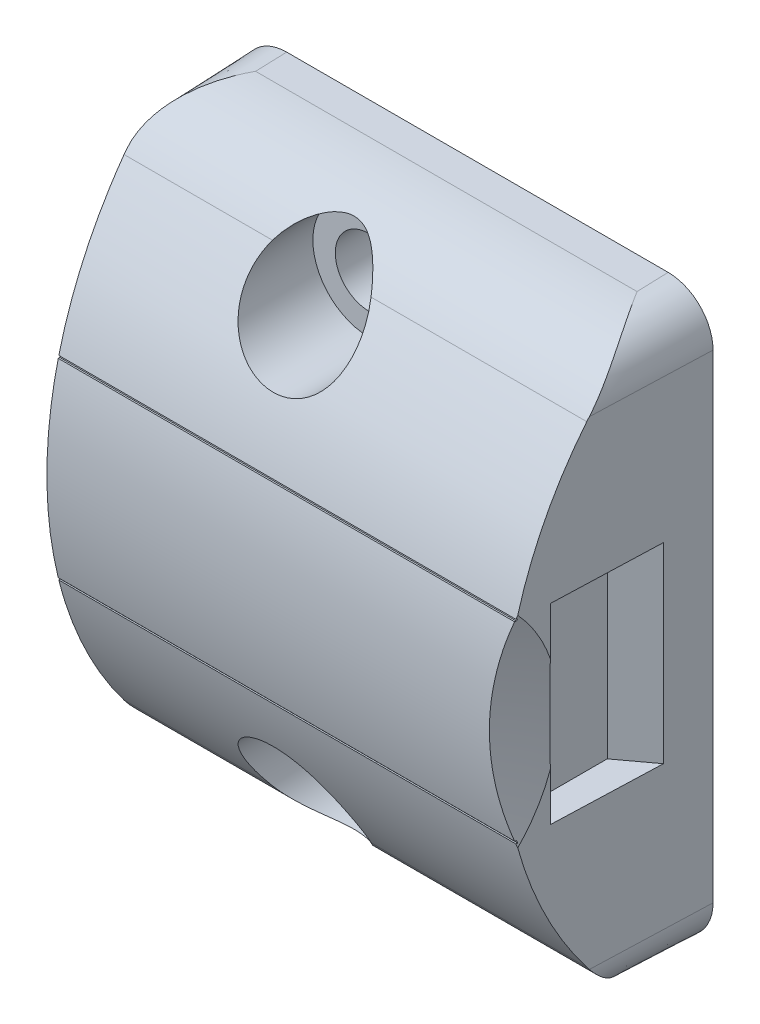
ISO-10303-21;
HEADER;
FILE_DESCRIPTION(('STEP AP214'),'2;1');
FILE_NAME('part.step','',(''),(''),'','','');
FILE_SCHEMA(('AUTOMOTIVE_DESIGN { 1 0 10303 214 1 1 1 1 }'));
ENDSEC;
DATA;
#1=APPLICATION_CONTEXT('core data for automotive mechanical design processes');
#2=APPLICATION_PROTOCOL_DEFINITION('international standard','automotive_design',2000,#1);
#3=PRODUCT_CONTEXT('',#1,'mechanical');
#4=PRODUCT('Part','Part','',(#3));
#5=PRODUCT_RELATED_PRODUCT_CATEGORY('part','',(#4));
#6=PRODUCT_DEFINITION_FORMATION('','',#4);
#7=PRODUCT_DEFINITION_CONTEXT('part definition',#1,'design');
#8=PRODUCT_DEFINITION('design','',#6,#7);
#9=PRODUCT_DEFINITION_SHAPE('','',#8);
#10=(LENGTH_UNIT() NAMED_UNIT(*) SI_UNIT(.MILLI.,.METRE.));
#11=(NAMED_UNIT(*) PLANE_ANGLE_UNIT() SI_UNIT($,.RADIAN.));
#12=(NAMED_UNIT(*) SI_UNIT($,.STERADIAN.) SOLID_ANGLE_UNIT());
#13=UNCERTAINTY_MEASURE_WITH_UNIT(LENGTH_MEASURE(1.E-05),#10,'distance_accuracy_value','');
#14=(GEOMETRIC_REPRESENTATION_CONTEXT(3) GLOBAL_UNCERTAINTY_ASSIGNED_CONTEXT((#13)) GLOBAL_UNIT_ASSIGNED_CONTEXT((#10,
#11,#12)) REPRESENTATION_CONTEXT('',''));
#15=CARTESIAN_POINT('',(0.,0.,0.));
#16=DIRECTION('',(0.,0.,1.));
#17=DIRECTION('',(1.,0.,0.));
#18=AXIS2_PLACEMENT_3D('',#15,#16,#17);
#19=CARTESIAN_POINT('',(-32.0000000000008,13.9999999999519,-12.5000000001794));
#20=DIRECTION('',(-1.,0.,0.));
#21=DIRECTION('',(0.,-1.,0.));
#22=AXIS2_PLACEMENT_3D('',#19,#20,#21);
#23=CYLINDRICAL_SURFACE('',#22,25.9000000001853);
#24=DIRECTION('',(-1.,0.,0.));
#25=VECTOR('',#24,1.);
#26=CARTESIAN_POINT('',(-32.0000000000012,20.4999999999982,12.5710988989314));
#27=LINE('',#26,#25);
#28=CARTESIAN_POINT('',(-13.0610075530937,20.4999999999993,12.5710988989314));
#29=VERTEX_POINT('',#28);
#30=CARTESIAN_POINT('',(17.5187123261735,20.4999999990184,12.5710988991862));
#31=VERTEX_POINT('',#30);
#32=EDGE_CURVE('E175',#29,#31,#27,.F.);
#33=ORIENTED_EDGE('',*,*,#32,.F.);
#34=CARTESIAN_POINT('',(-13.9365096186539,13.9999999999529,-12.5000000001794));
#35=DIRECTION('',(-0.999390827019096,0.,0.034899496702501));
#36=DIRECTION('',(-0.034899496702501,0.,-0.999390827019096));
#37=AXIS2_PLACEMENT_3D('',#34,#35,#36);
#38=ELLIPSE('',#37,25.9157871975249,25.9000000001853);
#39=CARTESIAN_POINT('',(-13.0596662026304,20.3499999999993,12.6095101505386));
#40=VERTEX_POINT('',#39);
#41=EDGE_CURVE('E179',#29,#40,#38,.F.);
#42=ORIENTED_EDGE('',*,*,#41,.T.);
#43=DIRECTION('',(-1.,0.,0.));
#44=VECTOR('',#43,1.);
#45=CARTESIAN_POINT('',(-32.0000000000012,20.3499999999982,12.6095101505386));
#46=LINE('',#45,#44);
#47=CARTESIAN_POINT('',(17.4744020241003,20.34999999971,12.6095101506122));
#48=VERTEX_POINT('',#47);
#49=EDGE_CURVE('E177',#48,#40,#46,.T.);
#50=ORIENTED_EDGE('',*,*,#49,.F.);
#51=CARTESIAN_POINT('',(17.4744020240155,20.3499999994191,12.6095101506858));
#52=CARTESIAN_POINT('',(17.4817021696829,20.375042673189,12.6031769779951));
#53=CARTESIAN_POINT('',(17.4890447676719,20.4000640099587,12.596809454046));
#54=CARTESIAN_POINT('',(17.5038148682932,20.4500640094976,12.5840057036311));
#55=CARTESIAN_POINT('',(17.5112423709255,20.4750426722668,12.5775694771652));
#56=CARTESIAN_POINT('',(17.5187123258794,20.4999999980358,12.5710988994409));
#57=B_SPLINE_CURVE_WITH_KNOTS('',3,(#51,#52,#53,#54,#55,#56),.UNSPECIFIED.,.F.,.F.,(4,2,4),(0.,
0.0805278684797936,0.161055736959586),.UNSPECIFIED.);
#58=EDGE_CURVE('E18',#48,#31,#57,.T.);
#59=ORIENTED_EDGE('',*,*,#58,.T.);
#60=EDGE_LOOP('',(#33,#42,#50,#59));
#61=FACE_BOUND('',#60,.T.);
#62=ADVANCED_FACE('F14',(#61),#23,.T.);
#63=CARTESIAN_POINT('',(-32.0000000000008,14.0000000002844,-12.5000000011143));
#64=DIRECTION('',(-1.,0.,0.));
#65=DIRECTION('',(0.,-1.,0.));
#66=AXIS2_PLACEMENT_3D('',#63,#64,#65);
#67=CYLINDRICAL_SURFACE('',#66,25.9000000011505);
#68=DIRECTION('',(-1.,0.,0.));
#69=VECTOR('',#68,1.);
#70=CARTESIAN_POINT('',(-32.0000000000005,7.64999999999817,12.6095101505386));
#71=LINE('',#70,#69);
#72=CARTESIAN_POINT('',(-13.0596662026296,7.64999999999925,12.6095101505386));
#73=VERTEX_POINT('',#72);
#74=CARTESIAN_POINT('',(17.4744020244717,7.64999999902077,12.6095101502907));
#75=VERTEX_POINT('',#74);
#76=EDGE_CURVE('E265',#73,#75,#71,.F.);
#77=ORIENTED_EDGE('',*,*,#76,.F.);
#78=CARTESIAN_POINT('',(-13.9365096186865,14.0000000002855,-12.5000000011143));
#79=DIRECTION('',(-0.999390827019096,0.,0.034899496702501));
#80=DIRECTION('',(-0.034899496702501,0.,-0.999390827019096));
#81=AXIS2_PLACEMENT_3D('',#78,#79,#80);
#82=ELLIPSE('',#81,25.9157871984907,25.9000000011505);
#83=CARTESIAN_POINT('',(-13.0610075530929,7.49999999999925,12.5710988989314));
#84=VERTEX_POINT('',#83);
#85=EDGE_CURVE('E241',#73,#84,#82,.F.);
#86=ORIENTED_EDGE('',*,*,#85,.T.);
#87=DIRECTION('',(-1.,0.,0.));
#88=VECTOR('',#87,1.);
#89=CARTESIAN_POINT('',(-32.0000000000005,7.49999999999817,12.5710988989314));
#90=LINE('',#89,#88);
#91=CARTESIAN_POINT('',(17.5187123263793,7.50000000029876,12.5710988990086));
#92=VERTEX_POINT('',#91);
#93=EDGE_CURVE('E256',#92,#84,#90,.T.);
#94=ORIENTED_EDGE('',*,*,#93,.F.);
#95=CARTESIAN_POINT('',(17.5187123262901,7.50000000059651,12.5710988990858));
#96=CARTESIAN_POINT('',(17.5112423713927,7.52495732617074,12.577569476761));
#97=CARTESIAN_POINT('',(17.5038148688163,7.54993598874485,12.5840057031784));
#98=CARTESIAN_POINT('',(17.4890447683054,7.59993598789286,12.5968094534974));
#99=CARTESIAN_POINT('',(17.4817021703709,7.62495732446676,12.603176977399));
#100=CARTESIAN_POINT('',(17.4744020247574,7.64999999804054,12.6095101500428));
#101=B_SPLINE_CURVE_WITH_KNOTS('',3,(#95,#96,#97,#98,#99,#100),.UNSPECIFIED.,.F.,.F.,(4,2,4),
(0.,0.0805278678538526,0.161055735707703),.UNSPECIFIED.);
#102=EDGE_CURVE('E235',#92,#75,#101,.T.);
#103=ORIENTED_EDGE('',*,*,#102,.T.);
#104=EDGE_LOOP('',(#77,#86,#94,#103));
#105=FACE_BOUND('',#104,.T.);
#106=ADVANCED_FACE('F229',(#105),#67,.T.);
#107=CARTESIAN_POINT('',(15.7299999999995,7.6000000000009,9.1));
#108=DIRECTION('',(1.,0.,0.));
#109=DIRECTION('',(0.,1.,0.));
#110=AXIS2_PLACEMENT_3D('',#107,#108,#109);
#111=PLANE('',#110);
#112=DIRECTION('',(0.,0.,-1.));
#113=VECTOR('',#112,1.);
#114=CARTESIAN_POINT('',(15.7299999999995,7.6000000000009,0.));
#115=LINE('',#114,#113);
#116=CARTESIAN_POINT('',(15.7299999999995,7.6000000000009,4.8));
#117=VERTEX_POINT('',#116);
#118=CARTESIAN_POINT('',(15.7299999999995,7.6000000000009,9.1));
#119=VERTEX_POINT('',#118);
#120=EDGE_CURVE('E283',#117,#119,#115,.F.);
#121=ORIENTED_EDGE('',*,*,#120,.F.);
#122=DIRECTION('',(0.,-1.,0.));
#123=VECTOR('',#122,1.);
#124=CARTESIAN_POINT('',(15.7299999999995,7.6000000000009,4.8));
#125=LINE('',#124,#123);
#126=CARTESIAN_POINT('',(15.7299999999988,20.4000000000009,4.8));
#127=VERTEX_POINT('',#126);
#128=EDGE_CURVE('E289',#127,#117,#125,.T.);
#129=ORIENTED_EDGE('',*,*,#128,.F.);
#130=DIRECTION('',(0.,0.,-1.));
#131=VECTOR('',#130,1.);
#132=CARTESIAN_POINT('',(15.7299999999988,20.4000000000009,0.));
#133=LINE('',#132,#131);
#134=CARTESIAN_POINT('',(15.7299999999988,20.4000000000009,9.1));
#135=VERTEX_POINT('',#134);
#136=EDGE_CURVE('E269',#127,#135,#133,.F.);
#137=ORIENTED_EDGE('',*,*,#136,.T.);
#138=DIRECTION('',(0.,-1.,0.));
#139=VECTOR('',#138,1.);
#140=CARTESIAN_POINT('',(15.7299999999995,7.6000000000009,9.1));
#141=LINE('',#140,#139);
#142=EDGE_CURVE('E276',#119,#135,#141,.F.);
#143=ORIENTED_EDGE('',*,*,#142,.F.);
#144=EDGE_LOOP('',(#121,#129,#137,#143));
#145=FACE_BOUND('',#144,.T.);
#146=ADVANCED_FACE('F225',(#145),#111,.T.);
#147=CARTESIAN_POINT('',(-32.0000000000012,20.4999999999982,18.));
#148=DIRECTION('',(0.,-1.,0.));
#149=DIRECTION('',(0.,0.,1.));
#150=AXIS2_PLACEMENT_3D('',#147,#148,#149);
#151=PLANE('',#150);
#152=CARTESIAN_POINT('',(17.518712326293,20.500000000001,12.571098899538));
#153=CARTESIAN_POINT('',(17.5137587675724,20.500000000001,12.588305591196));
#154=CARTESIAN_POINT('',(17.5088205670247,20.500000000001,12.6055166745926));
#155=CARTESIAN_POINT('',(17.4989748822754,20.500000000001,12.6399476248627));
#156=CARTESIAN_POINT('',(17.4940673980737,20.500000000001,12.6571674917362));
#157=CARTESIAN_POINT('',(17.4891752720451,20.500000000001,12.6743917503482));
#158=B_SPLINE_CURVE_WITH_KNOTS('',3,(#152,#153,#154,#155,#156,#157),.UNSPECIFIED.,.F.,.F.,(4,2,
4),(0.,0.0537165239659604,0.107433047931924),.UNSPECIFIED.);
#159=CARTESIAN_POINT('',(17.489175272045,20.500000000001,12.6743917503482));
#160=VERTEX_POINT('',#159);
#161=EDGE_CURVE('E184',#31,#160,#158,.T.);
#162=ORIENTED_EDGE('',*,*,#161,.T.);
#163=DIRECTION('',(-1.,0.,0.));
#164=VECTOR('',#163,1.);
#165=CARTESIAN_POINT('',(-17.0000000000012,20.4999999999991,12.6743917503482));
#166=LINE('',#165,#164);
#167=CARTESIAN_POINT('',(-13.0574004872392,20.4999999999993,12.6743917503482));
#168=VERTEX_POINT('',#167);
#169=EDGE_CURVE('E413',#168,#160,#166,.F.);
#170=ORIENTED_EDGE('',*,*,#169,.F.);
#171=DIRECTION('',(-0.034899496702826,0.,-0.999390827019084));
#172=VECTOR('',#171,1.);
#173=CARTESIAN_POINT('',(-13.0574004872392,20.4999999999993,12.6743917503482));
#174=LINE('',#173,#172);
#175=EDGE_CURVE('E186',#168,#29,#174,.T.);
#176=ORIENTED_EDGE('',*,*,#175,.T.);
#177=ORIENTED_EDGE('',*,*,#32,.T.);
#178=EDGE_LOOP('',(#162,#170,#176,#177));
#179=FACE_BOUND('',#178,.T.);
#180=ADVANCED_FACE('F182',(#179),#151,.T.);
#181=CARTESIAN_POINT('',(-1.60288449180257E-12,28.,20.));
#182=DIRECTION('',(0.,0.,-1.));
#183=DIRECTION('',(0.,-1.,0.));
#184=AXIS2_PLACEMENT_3D('',#181,#182,#183);
#185=CYLINDRICAL_SURFACE('',#184,3.75);
#186=CARTESIAN_POINT('',(-1.60288449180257E-12,28.,5.));
#187=DIRECTION('',(0.,0.,-1.));
#188=DIRECTION('',(0.,-1.,0.));
#189=AXIS2_PLACEMENT_3D('',#186,#187,#188);
#190=CIRCLE('',#189,3.75);
#191=CARTESIAN_POINT('',(-1.38805999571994E-12,24.25,5.));
#192=VERTEX_POINT('',#191);
#193=EDGE_CURVE('E273',#192,#192,#190,.F.);
#194=ORIENTED_EDGE('',*,*,#193,.F.);
#195=EDGE_LOOP('',(#194));
#196=FACE_BOUND('',#195,.T.);
#197=CARTESIAN_POINT('',(3.29463298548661,29.7910593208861,8.1553248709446));
#198=CARTESIAN_POINT('',(3.35768381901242,29.6750414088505,8.24403740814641));
#199=CARTESIAN_POINT('',(3.41442283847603,29.5561039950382,8.33340076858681));
#200=CARTESIAN_POINT('',(3.5150201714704,29.3131850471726,8.51259060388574));
#201=CARTESIAN_POINT('',(3.55887538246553,29.1892023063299,8.60241718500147));
#202=CARTESIAN_POINT('',(3.63360282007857,28.9364170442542,8.78209720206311));
#203=CARTESIAN_POINT('',(3.66440937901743,28.8075936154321,8.8719485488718));
#204=CARTESIAN_POINT('',(3.71232071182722,28.546604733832,9.05043534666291));
#205=CARTESIAN_POINT('',(3.72942670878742,28.4144395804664,9.13907090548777));
#206=CARTESIAN_POINT('',(3.74908350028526,28.1529335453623,9.31096051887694));
#207=CARTESIAN_POINT('',(3.75217483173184,28.0236829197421,9.39428976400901));
#208=CARTESIAN_POINT('',(3.74481934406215,27.7640005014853,9.5584649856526));
#209=CARTESIAN_POINT('',(3.73437437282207,27.633568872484,9.63931129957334));
#210=CARTESIAN_POINT('',(3.69951884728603,27.3728358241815,9.79776899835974));
#211=CARTESIAN_POINT('',(3.67512739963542,27.2425344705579,9.87538465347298));
#212=CARTESIAN_POINT('',(3.6120060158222,26.9832934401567,10.0267973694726));
#213=CARTESIAN_POINT('',(3.57328653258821,26.854352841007,10.1005971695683));
#214=CARTESIAN_POINT('',(3.48534441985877,26.6107158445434,10.2373609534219));
#215=CARTESIAN_POINT('',(3.4373755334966,26.4957792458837,10.3007031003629));
#216=CARTESIAN_POINT('',(3.32923255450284,26.2695623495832,10.4232277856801));
#217=CARTESIAN_POINT('',(3.26906566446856,26.1582799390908,10.4824127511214));
#218=CARTESIAN_POINT('',(3.13659194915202,25.9407521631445,10.5961793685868));
#219=CARTESIAN_POINT('',(3.06428986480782,25.8345048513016,10.6507628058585));
#220=CARTESIAN_POINT('',(2.90779210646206,25.6285097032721,10.7549151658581));
#221=CARTESIAN_POINT('',(2.82359876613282,25.5287605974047,10.8044850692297));
#222=CARTESIAN_POINT('',(2.65713336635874,25.3514786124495,10.891284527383));
#223=CARTESIAN_POINT('',(2.57641904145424,25.2728419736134,10.929254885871));
#224=CARTESIAN_POINT('',(2.4071922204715,25.1223726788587,11.0010589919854));
#225=CARTESIAN_POINT('',(2.31868104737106,25.0505388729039,11.0348934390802));
#226=CARTESIAN_POINT('',(2.13452008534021,24.9146454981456,11.0982231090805));
#227=CARTESIAN_POINT('',(2.03887483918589,24.8505810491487,11.1277210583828));
#228=CARTESIAN_POINT('',(1.8411501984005,24.7310542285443,11.1822463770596));
#229=CARTESIAN_POINT('',(1.73907145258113,24.6755909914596,11.2072741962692));
#230=CARTESIAN_POINT('',(1.54156316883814,24.5799580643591,11.2500927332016));
#231=CARTESIAN_POINT('',(1.44673870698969,24.5387602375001,11.2683864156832));
#232=CARTESIAN_POINT('',(1.25341652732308,24.4641573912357,11.3013250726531));
#233=CARTESIAN_POINT('',(1.15491764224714,24.43075487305,11.3159688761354));
#234=CARTESIAN_POINT('',(0.955111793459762,24.3721779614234,11.3415382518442));
#235=CARTESIAN_POINT('',(0.853806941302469,24.3469975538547,11.3524665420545));
#236=CARTESIAN_POINT('',(0.64908820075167,24.3051247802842,11.3705870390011));
#237=CARTESIAN_POINT('',(0.545673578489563,24.288435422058,11.3777779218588));
#238=CARTESIAN_POINT('',(0.343924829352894,24.2645077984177,11.3880731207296));
#239=CARTESIAN_POINT('',(0.245662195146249,24.2567584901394,11.3913985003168));
#240=CARTESIAN_POINT('',(0.0487390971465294,24.2490218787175,11.3947184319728));
#241=CARTESIAN_POINT('',(-0.0499214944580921,24.249037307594,11.3947118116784));
#242=CARTESIAN_POINT('',(-0.246826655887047,24.2568356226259,11.3913654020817));
#243=CARTESIAN_POINT('',(-0.345071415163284,24.2646144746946,11.3880273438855));
#244=CARTESIAN_POINT('',(-0.54051247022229,24.2878529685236,11.3780284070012));
#245=CARTESIAN_POINT('',(-0.637708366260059,24.303315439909,11.3713663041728));
#246=CARTESIAN_POINT('',(-0.828774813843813,24.341453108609,11.354868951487));
#247=CARTESIAN_POINT('',(-0.922673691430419,24.3640088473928,11.3450862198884));
#248=CARTESIAN_POINT('',(-1.1081122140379,24.4161636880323,11.3223495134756));
#249=CARTESIAN_POINT('',(-1.19965100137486,24.4457653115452,11.3093944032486));
#250=CARTESIAN_POINT('',(-1.46972320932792,24.5447037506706,11.2658255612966));
#251=CARTESIAN_POINT('',(-1.64390861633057,24.6242138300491,11.2304914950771));
#252=CARTESIAN_POINT('',(-1.97934542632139,24.8090481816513,11.1468794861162));
#253=CARTESIAN_POINT('',(-2.14025638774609,24.9148705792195,11.0983498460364));
#254=CARTESIAN_POINT('',(-2.44162469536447,25.1474223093,10.9893898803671));
#255=CARTESIAN_POINT('',(-2.58207808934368,25.2741556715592,10.9289572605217));
#256=CARTESIAN_POINT('',(-2.84751359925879,25.5519047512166,10.793318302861));
#257=CARTESIAN_POINT('',(-2.97113408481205,25.7039000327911,10.7174603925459));
#258=CARTESIAN_POINT('',(-3.19119282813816,26.0210880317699,10.5548308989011));
#259=CARTESIAN_POINT('',(-3.28762217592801,26.186285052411,10.4680557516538));
#260=CARTESIAN_POINT('',(-3.46093842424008,26.5415191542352,10.2761901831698));
#261=CARTESIAN_POINT('',(-3.53500737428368,26.732408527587,10.1701390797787));
#262=CARTESIAN_POINT('',(-3.65053405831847,27.118639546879,9.94885152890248));
#263=CARTESIAN_POINT('',(-3.69197496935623,27.3139834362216,9.83361037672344));
#264=CARTESIAN_POINT('',(-3.74685913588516,27.7297764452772,9.58075560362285));
#265=CARTESIAN_POINT('',(-3.75598838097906,27.9502051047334,9.4421760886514));
#266=CARTESIAN_POINT('',(-3.73648952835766,28.3856145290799,9.15921523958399));
#267=CARTESIAN_POINT('',(-3.70784350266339,28.6005926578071,9.01483118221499));
#268=CARTESIAN_POINT('',(-3.6233754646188,28.9820649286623,8.75044165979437));
#269=CARTESIAN_POINT('',(-3.57353653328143,29.1501913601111,8.63084861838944));
#270=CARTESIAN_POINT('',(-3.48164223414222,29.3958116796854,8.45183152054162));
#271=CARTESIAN_POINT('',(-3.44819698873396,29.4765124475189,8.39228086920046));
#272=CARTESIAN_POINT('',(-3.37564653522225,29.6355864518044,8.27350007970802));
#273=CARTESIAN_POINT('',(-3.33654071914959,29.7139594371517,8.21426997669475));
#274=CARTESIAN_POINT('',(-3.29463298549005,29.7910593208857,8.15532487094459));
#275=B_SPLINE_CURVE_WITH_KNOTS('',3,(#197,#198,#199,#200,#201,#202,#203,#204,#205,#206,#207,
#208,#209,#210,#211,#212,#213,#214,#215,#216,#217,#218,#219,#220,#221,#222,#223,#224,#225,#226,
#227,#228,#229,#230,#231,#232,#233,#234,#235,#236,#237,#238,#239,#240,#241,#242,#243,#244,#245,
#246,#247,#248,#249,#250,#251,#252,#253,#254,#255,#256,#257,#258,#259,#260,#261,#262,#263,#264,
#265,#266,#267,#268,#269,#270,#271,#272,#273,#274),.UNSPECIFIED.,.F.,.F.,(4,2,2,2,2,2,2,2,2,2,2,
2,2,2,2,2,2,2,2,2,2,2,2,2,2,2,2,2,2,2,2,2,2,2,2,2,2,2,4),(0.,0.477065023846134,
0.954244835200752,1.43379832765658,1.91330900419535,2.3741585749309,2.83494524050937,
3.29510213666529,3.7549239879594,4.17349796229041,4.59182549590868,5.00998997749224,
5.42807250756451,5.78431676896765,6.14050069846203,6.49645972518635,6.85238291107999,
7.16696029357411,7.48163847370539,7.79608596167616,8.11064475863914,8.40615839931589,
8.70177601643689,8.99724010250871,9.29281307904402,9.58365318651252,9.87459753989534,
10.4558911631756,11.0491618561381,11.6425470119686,12.270195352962,12.8980491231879,
13.5870511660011,14.2764082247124,15.0549184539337,15.8337982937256,16.4690987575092,
16.7861126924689,17.1031607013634),.UNSPECIFIED.);
#276=CARTESIAN_POINT('',(3.29463298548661,29.7910593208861,8.1553248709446));
#277=VERTEX_POINT('',#276);
#278=CARTESIAN_POINT('',(-3.29463298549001,29.7910593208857,8.1553248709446));
#279=VERTEX_POINT('',#278);
#280=EDGE_CURVE('E389',#277,#279,#275,.T.);
#281=ORIENTED_EDGE('',*,*,#280,.F.);
#282=CARTESIAN_POINT('',(-3.29463298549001,29.7910593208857,8.15532487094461));
#283=CARTESIAN_POINT('',(-3.23169624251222,29.9067436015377,8.06690922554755));
#284=CARTESIAN_POINT('',(-3.16332381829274,30.0180764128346,7.97676718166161));
#285=CARTESIAN_POINT('',(-3.01630014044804,30.2318939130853,7.79431075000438));
#286=CARTESIAN_POINT('',(-2.93764619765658,30.3343762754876,7.70199579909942));
#287=CARTESIAN_POINT('',(-2.76985998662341,30.5312556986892,7.51560450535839));
#288=CARTESIAN_POINT('',(-2.68063177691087,30.6255627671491,7.42151977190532));
#289=CARTESIAN_POINT('',(-2.49253522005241,30.8047542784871,7.2340590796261));
#290=CARTESIAN_POINT('',(-2.39366993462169,30.8896416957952,7.1406829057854));
#291=CARTESIAN_POINT('',(-2.21882912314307,31.0244572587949,6.98561554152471));
#292=CARTESIAN_POINT('',(-2.14546160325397,31.0769706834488,6.92321460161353));
#293=CARTESIAN_POINT('',(-1.99393117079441,31.1772620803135,6.80047726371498));
#294=CARTESIAN_POINT('',(-1.91576936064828,31.2250411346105,6.74014039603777));
#295=CARTESIAN_POINT('',(-1.75459240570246,31.3154821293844,6.62271291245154));
#296=CARTESIAN_POINT('',(-1.67159134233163,31.3581579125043,6.56561374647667));
#297=CARTESIAN_POINT('',(-1.5002615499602,31.4381167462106,6.455867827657));
#298=CARTESIAN_POINT('',(-1.41193542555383,31.4754024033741,6.40321892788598));
#299=CARTESIAN_POINT('',(-1.20606256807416,31.5528777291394,6.29131045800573));
#300=CARTESIAN_POINT('',(-1.08685264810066,31.591338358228,6.23384531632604));
#301=CARTESIAN_POINT('',(-0.839532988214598,31.6570434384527,6.13355316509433));
#302=CARTESIAN_POINT('',(-0.711441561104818,31.6843102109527,6.09069705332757));
#303=CARTESIAN_POINT('',(-0.47003233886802,31.7220804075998,6.03062744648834));
#304=CARTESIAN_POINT('',(-0.35782480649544,31.7346242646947,6.01032478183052));
#305=CARTESIAN_POINT('',(-0.130982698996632,31.7494299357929,5.98631555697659));
#306=CARTESIAN_POINT('',(-0.0163501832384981,31.751700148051,5.98259544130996));
#307=CARTESIAN_POINT('',(0.211852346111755,31.7457513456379,5.99227615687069));
#308=CARTESIAN_POINT('',(0.325422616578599,31.7375349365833,6.00567273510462));
#309=CARTESIAN_POINT('',(0.548537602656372,31.7113705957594,6.04771194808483));
#310=CARTESIAN_POINT('',(0.658077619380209,31.693411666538,6.0763718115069));
#311=CARTESIAN_POINT('',(0.920501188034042,31.6387515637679,6.16180123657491));
#312=CARTESIAN_POINT('',(1.07010252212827,31.5972274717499,6.22543807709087));
#313=CARTESIAN_POINT('',(1.35613703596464,31.4994874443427,6.36922134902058));
#314=CARTESIAN_POINT('',(1.49252097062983,31.4432192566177,6.44942627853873));
#315=CARTESIAN_POINT('',(1.73008642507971,31.3291843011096,6.60474917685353));
#316=CARTESIAN_POINT('',(1.83326180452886,31.2733856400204,6.67831990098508));
#317=CARTESIAN_POINT('',(2.03179588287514,31.1540033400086,6.82968637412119));
#318=CARTESIAN_POINT('',(2.12714932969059,31.0904145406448,6.90748490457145));
#319=CARTESIAN_POINT('',(2.31044825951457,30.9558841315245,7.06547121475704));
#320=CARTESIAN_POINT('',(2.39839105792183,30.8849398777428,7.14565984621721));
#321=CARTESIAN_POINT('',(2.56699534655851,30.7359975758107,7.3070021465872));
#322=CARTESIAN_POINT('',(2.64765947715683,30.658002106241,7.38815545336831));
#323=CARTESIAN_POINT('',(2.83542627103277,30.4594358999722,7.58583228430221));
#324=CARTESIAN_POINT('',(2.93869524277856,30.3351446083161,7.70232855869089));
#325=CARTESIAN_POINT('',(3.08150716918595,30.1385350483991,7.87457461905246));
#326=CARTESIAN_POINT('',(3.12701540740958,30.0714500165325,7.93146023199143));
#327=CARTESIAN_POINT('',(3.21394010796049,29.9338318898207,8.04422246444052));
#328=CARTESIAN_POINT('',(3.25535544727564,29.863297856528,8.1000988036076));
#329=CARTESIAN_POINT('',(3.29463298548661,29.7910593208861,8.15532487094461));
#330=B_SPLINE_CURVE_WITH_KNOTS('',3,(#282,#283,#284,#285,#286,#287,#288,#289,#290,#291,#292,
#293,#294,#295,#296,#297,#298,#299,#300,#301,#302,#303,#304,#305,#306,#307,#308,#309,#310,#311,
#312,#313,#314,#315,#316,#317,#318,#319,#320,#321,#322,#323,#324,#325,#326,#327,#328,#329),
.UNSPECIFIED.,.F.,.F.,(4,2,2,2,2,2,2,2,2,2,2,2,2,2,2,2,2,2,2,2,2,2,2,4),(0.,0.475628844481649,
0.951382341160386,1.4318412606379,1.91214803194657,2.24105614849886,2.56988891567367,
2.89780845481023,3.22556888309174,3.63781907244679,4.04924316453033,4.39188432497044,
4.73424534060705,5.07652130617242,5.4191844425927,5.9197203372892,6.42205467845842,
6.83689285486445,7.25200733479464,7.66727155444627,8.08238452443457,8.67874141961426,
8.97571248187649,9.2727648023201),.UNSPECIFIED.);
#331=EDGE_CURVE('E193',#279,#277,#330,.T.);
#332=ORIENTED_EDGE('',*,*,#331,.F.);
#333=EDGE_LOOP('',(#281,#332));
#334=FACE_BOUND('',#333,.T.);
#335=ADVANCED_FACE('F224',(#196,#334),#185,.F.);
#336=CARTESIAN_POINT('',(-32.0000000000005,7.49999999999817,12.5710988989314));
#337=DIRECTION('',(0.,1.,0.));
#338=DIRECTION('',(0.,0.,-1.));
#339=AXIS2_PLACEMENT_3D('',#336,#337,#338);
#340=PLANE('',#339);
#341=CARTESIAN_POINT('',(17.4891752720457,7.500000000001,12.6743917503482));
#342=CARTESIAN_POINT('',(17.4940673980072,7.500000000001,12.657167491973));
#343=CARTESIAN_POINT('',(17.4989748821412,7.50000000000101,12.6399476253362));
#344=CARTESIAN_POINT('',(17.5088205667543,7.50000000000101,12.6055166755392));
#345=CARTESIAN_POINT('',(17.5137587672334,7.500000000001,12.5883055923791));
#346=CARTESIAN_POINT('',(17.5187123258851,7.500000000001,12.5710989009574));
#347=B_SPLINE_CURVE_WITH_KNOTS('',3,(#341,#342,#343,#344,#345,#346),.UNSPECIFIED.,.F.,.F.,(4,2,
4),(0.,0.0537165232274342,0.107433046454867),.UNSPECIFIED.);
#348=CARTESIAN_POINT('',(17.4891752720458,7.50000000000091,12.6743917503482));
#349=VERTEX_POINT('',#348);
#350=EDGE_CURVE('E465',#349,#92,#347,.T.);
#351=ORIENTED_EDGE('',*,*,#350,.T.);
#352=ORIENTED_EDGE('',*,*,#93,.T.);
#353=DIRECTION('',(0.034899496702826,0.,0.999390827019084));
#354=VECTOR('',#353,1.);
#355=CARTESIAN_POINT('',(-13.0610075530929,7.49999999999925,12.5710988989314));
#356=LINE('',#355,#354);
#357=CARTESIAN_POINT('',(-13.0574004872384,7.49999999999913,12.6743917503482));
#358=VERTEX_POINT('',#357);
#359=EDGE_CURVE('E188',#84,#358,#356,.T.);
#360=ORIENTED_EDGE('',*,*,#359,.T.);
#361=DIRECTION('',(-1.,0.,0.));
#362=VECTOR('',#361,1.);
#363=CARTESIAN_POINT('',(-17.0000000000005,7.49999999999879,12.6743917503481));
#364=LINE('',#363,#362);
#365=EDGE_CURVE('E384',#349,#358,#364,.T.);
#366=ORIENTED_EDGE('',*,*,#365,.F.);
#367=EDGE_LOOP('',(#351,#352,#360,#366));
#368=FACE_BOUND('',#367,.T.);
#369=ADVANCED_FACE('F668',(#368),#340,.T.);
#370=CARTESIAN_POINT('',(-32.0000000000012,20.3499999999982,12.6095101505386));
#371=DIRECTION('',(0.,1.,0.));
#372=DIRECTION('',(0.,0.,-1.));
#373=AXIS2_PLACEMENT_3D('',#370,#371,#372);
#374=PLANE('',#373);
#375=CARTESIAN_POINT('',(17.4450913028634,20.350000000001,12.7126456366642));
#376=CARTESIAN_POINT('',(17.4499458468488,20.350000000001,12.6954476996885));
#377=CARTESIAN_POINT('',(17.4548156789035,20.350000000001,12.6782541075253));
#378=CARTESIAN_POINT('',(17.4645859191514,20.350000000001,12.6438756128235));
#379=CARTESIAN_POINT('',(17.4694863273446,20.350000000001,12.626690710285));
#380=CARTESIAN_POINT('',(17.4744020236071,20.350000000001,12.6095101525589));
#381=B_SPLINE_CURVE_WITH_KNOTS('',3,(#375,#376,#377,#378,#379,#380),.UNSPECIFIED.,.F.,.F.,(4,2,
4),(0.,0.0536098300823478,0.107219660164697),.UNSPECIFIED.);
#382=CARTESIAN_POINT('',(17.4450913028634,20.350000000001,12.7126456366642));
#383=VERTEX_POINT('',#382);
#384=EDGE_CURVE('E194',#383,#48,#381,.T.);
#385=ORIENTED_EDGE('',*,*,#384,.T.);
#386=ORIENTED_EDGE('',*,*,#49,.T.);
#387=DIRECTION('',(0.0348994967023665,0.,0.999390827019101));
#388=VECTOR('',#387,1.);
#389=CARTESIAN_POINT('',(-13.0596662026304,20.3499999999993,12.6095101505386));
#390=LINE('',#389,#388);
#391=CARTESIAN_POINT('',(-13.056064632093,20.3499999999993,12.7126456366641));
#392=VERTEX_POINT('',#391);
#393=EDGE_CURVE('E248',#40,#392,#390,.T.);
#394=ORIENTED_EDGE('',*,*,#393,.T.);
#395=DIRECTION('',(-1.,0.,0.));
#396=VECTOR('',#395,1.);
#397=CARTESIAN_POINT('',(-17.0000000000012,20.349999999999,12.7126456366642));
#398=LINE('',#397,#396);
#399=EDGE_CURVE('E542',#383,#392,#398,.T.);
#400=ORIENTED_EDGE('',*,*,#399,.F.);
#401=EDGE_LOOP('',(#385,#386,#394,#400));
#402=FACE_BOUND('',#401,.T.);
#403=ADVANCED_FACE('F246',(#402),#374,.T.);
#404=CARTESIAN_POINT('',(-32.0000000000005,7.64999999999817,17.));
#405=DIRECTION('',(0.,-1.,0.));
#406=DIRECTION('',(0.,0.,1.));
#407=AXIS2_PLACEMENT_3D('',#404,#405,#406);
#408=PLANE('',#407);
#409=CARTESIAN_POINT('',(17.4744020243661,7.650000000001,12.6095101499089));
#410=CARTESIAN_POINT('',(17.4694863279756,7.650000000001,12.6266907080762));
#411=CARTESIAN_POINT('',(17.4645859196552,7.650000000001,12.6438756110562));
#412=CARTESIAN_POINT('',(17.4548156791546,7.650000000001,12.6782541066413));
#413=CARTESIAN_POINT('',(17.4499458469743,7.650000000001,12.6954476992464));
#414=CARTESIAN_POINT('',(17.445091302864,7.650000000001,12.7126456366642));
#415=B_SPLINE_CURVE_WITH_KNOTS('',3,(#409,#410,#411,#412,#413,#414),.UNSPECIFIED.,.F.,.F.,(4,2,
4),(0.,0.0536098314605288,0.10721966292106),.UNSPECIFIED.);
#416=CARTESIAN_POINT('',(17.445091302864,7.650000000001,12.7126456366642));
#417=VERTEX_POINT('',#416);
#418=EDGE_CURVE('E198',#75,#417,#415,.T.);
#419=ORIENTED_EDGE('',*,*,#418,.T.);
#420=DIRECTION('',(-1.,0.,0.));
#421=VECTOR('',#420,1.);
#422=CARTESIAN_POINT('',(-17.0000000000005,7.64999999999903,12.7126456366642));
#423=LINE('',#422,#421);
#424=CARTESIAN_POINT('',(-13.0560646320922,7.64999999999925,12.7126456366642));
#425=VERTEX_POINT('',#424);
#426=EDGE_CURVE('E540',#425,#417,#423,.F.);
#427=ORIENTED_EDGE('',*,*,#426,.F.);
#428=DIRECTION('',(-0.0348994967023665,0.,-0.999390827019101));
#429=VECTOR('',#428,1.);
#430=CARTESIAN_POINT('',(-13.0560646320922,7.64999999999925,12.7126456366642));
#431=LINE('',#430,#429);
#432=EDGE_CURVE('E250',#425,#73,#431,.T.);
#433=ORIENTED_EDGE('',*,*,#432,.T.);
#434=ORIENTED_EDGE('',*,*,#76,.T.);
#435=EDGE_LOOP('',(#419,#427,#433,#434));
#436=FACE_BOUND('',#435,.T.);
#437=ADVANCED_FACE('F371',(#436),#408,.T.);
#438=CARTESIAN_POINT('',(0.,0.,20.));
#439=DIRECTION('',(0.,0.,-1.));
#440=DIRECTION('',(0.,-1.,0.));
#441=AXIS2_PLACEMENT_3D('',#438,#439,#440);
#442=CYLINDRICAL_SURFACE('',#441,3.75);
#443=CARTESIAN_POINT('',(0.,0.,5.));
#444=DIRECTION('',(0.,0.,-1.));
#445=DIRECTION('',(0.,-1.,0.));
#446=AXIS2_PLACEMENT_3D('',#443,#444,#445);
#447=CIRCLE('',#446,3.75);
#448=CARTESIAN_POINT('',(2.14824496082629E-13,-3.75,5.));
#449=VERTEX_POINT('',#448);
#450=EDGE_CURVE('E267',#449,#449,#447,.F.);
#451=ORIENTED_EDGE('',*,*,#450,.F.);
#452=EDGE_LOOP('',(#451));
#453=FACE_BOUND('',#452,.T.);
#454=CARTESIAN_POINT('',(3.29463298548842,-1.79105932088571,8.15532487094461));
#455=CARTESIAN_POINT('',(3.23169624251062,-1.90674360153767,8.06690922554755));
#456=CARTESIAN_POINT('',(3.16332381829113,-2.01807641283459,7.97676718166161));
#457=CARTESIAN_POINT('',(3.01630014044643,-2.23189391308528,7.79431075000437));
#458=CARTESIAN_POINT('',(2.93764619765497,-2.33437627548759,7.7019957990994));
#459=CARTESIAN_POINT('',(2.76985998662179,-2.5312556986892,7.51560450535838));
#460=CARTESIAN_POINT('',(2.68063177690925,-2.6255627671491,7.42151977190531));
#461=CARTESIAN_POINT('',(2.4925352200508,-2.80475427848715,7.23405907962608));
#462=CARTESIAN_POINT('',(2.39366993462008,-2.88964169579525,7.14068290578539));
#463=CARTESIAN_POINT('',(2.21882912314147,-3.02445725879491,6.9856155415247));
#464=CARTESIAN_POINT('',(2.14546160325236,-3.0769706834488,6.92321460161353));
#465=CARTESIAN_POINT('',(1.99393117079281,-3.17726208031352,6.80047726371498));
#466=CARTESIAN_POINT('',(1.91576936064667,-3.22504113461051,6.74014039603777));
#467=CARTESIAN_POINT('',(1.75459240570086,-3.3154821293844,6.62271291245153));
#468=CARTESIAN_POINT('',(1.67159134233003,-3.35815791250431,6.56561374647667));
#469=CARTESIAN_POINT('',(1.5002615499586,-3.43811674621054,6.45586782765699));
#470=CARTESIAN_POINT('',(1.41193542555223,-3.47540240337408,6.40321892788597));
#471=CARTESIAN_POINT('',(1.20606256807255,-3.55287772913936,6.29131045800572));
#472=CARTESIAN_POINT('',(1.08685264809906,-3.59133835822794,6.23384531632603));
#473=CARTESIAN_POINT('',(0.839532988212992,-3.65704343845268,6.13355316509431));
#474=CARTESIAN_POINT('',(0.711441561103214,-3.68431021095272,6.09069705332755));
#475=CARTESIAN_POINT('',(0.470032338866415,-3.72208040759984,6.03062744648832));
#476=CARTESIAN_POINT('',(0.357824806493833,-3.73462426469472,6.01032478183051));
#477=CARTESIAN_POINT('',(0.130982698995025,-3.74942993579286,5.98631555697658));
#478=CARTESIAN_POINT('',(0.0163501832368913,-3.75170014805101,5.98259544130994));
#479=CARTESIAN_POINT('',(-0.211852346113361,-3.74575134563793,5.99227615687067));
#480=CARTESIAN_POINT('',(-0.325422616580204,-3.73753493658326,6.00567273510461));
#481=CARTESIAN_POINT('',(-0.548537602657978,-3.71137059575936,6.04771194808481));
#482=CARTESIAN_POINT('',(-0.658077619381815,-3.69341166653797,6.07637181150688));
#483=CARTESIAN_POINT('',(-0.920501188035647,-3.63875156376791,6.16180123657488));
#484=CARTESIAN_POINT('',(-1.07010252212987,-3.59722747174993,6.22543807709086));
#485=CARTESIAN_POINT('',(-1.35613703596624,-3.4994874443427,6.36922134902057));
#486=CARTESIAN_POINT('',(-1.49252097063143,-3.44321925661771,6.4494262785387));
#487=CARTESIAN_POINT('',(-1.73008642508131,-3.32918430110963,6.60474917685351));
#488=CARTESIAN_POINT('',(-1.83326180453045,-3.27338564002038,6.67831990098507));
#489=CARTESIAN_POINT('',(-2.03179588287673,-3.15400334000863,6.82968637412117));
#490=CARTESIAN_POINT('',(-2.12714932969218,-3.09041454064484,6.90748490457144));
#491=CARTESIAN_POINT('',(-2.31044825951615,-2.95588413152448,7.06547121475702));
#492=CARTESIAN_POINT('',(-2.39839105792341,-2.88493987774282,7.14565984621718));
#493=CARTESIAN_POINT('',(-2.56699534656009,-2.73599757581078,7.30700214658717));
#494=CARTESIAN_POINT('',(-2.64765947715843,-2.65800210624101,7.38815545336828));
#495=CARTESIAN_POINT('',(-2.83542627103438,-2.45943589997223,7.58583228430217));
#496=CARTESIAN_POINT('',(-2.93869524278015,-2.33514460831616,7.70232855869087));
#497=CARTESIAN_POINT('',(-3.08150716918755,-2.13853504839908,7.87457461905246));
#498=CARTESIAN_POINT('',(-3.12701540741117,-2.07145001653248,7.93146023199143));
#499=CARTESIAN_POINT('',(-3.21394010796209,-1.9338318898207,8.04422246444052));
#500=CARTESIAN_POINT('',(-3.25535544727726,-1.86329785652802,8.1000988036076));
#501=CARTESIAN_POINT('',(-3.29463298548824,-1.79105932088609,8.15532487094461));
#502=B_SPLINE_CURVE_WITH_KNOTS('',3,(#454,#455,#456,#457,#458,#459,#460,#461,#462,#463,#464,
#465,#466,#467,#468,#469,#470,#471,#472,#473,#474,#475,#476,#477,#478,#479,#480,#481,#482,#483,
#484,#485,#486,#487,#488,#489,#490,#491,#492,#493,#494,#495,#496,#497,#498,#499,#500,#501),
.UNSPECIFIED.,.F.,.F.,(4,2,2,2,2,2,2,2,2,2,2,2,2,2,2,2,2,2,2,2,2,2,2,4),(0.,0.475628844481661,
0.951382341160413,1.43184126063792,1.91214803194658,2.24105614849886,2.56988891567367,
2.89780845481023,3.22556888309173,3.6378190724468,4.04924316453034,4.39188432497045,
4.73424534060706,5.07652130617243,5.41918444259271,5.91972033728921,6.42205467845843,
6.83689285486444,7.25200733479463,7.66727155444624,8.08238452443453,8.67874141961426,
8.97571248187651,9.27276480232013),.UNSPECIFIED.);
#503=CARTESIAN_POINT('',(3.29463298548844,-1.79105932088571,8.15532487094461));
#504=VERTEX_POINT('',#503);
#505=CARTESIAN_POINT('',(-3.29463298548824,-1.79105932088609,8.15532487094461));
#506=VERTEX_POINT('',#505);
#507=EDGE_CURVE('E349',#504,#506,#502,.T.);
#508=ORIENTED_EDGE('',*,*,#507,.F.);
#509=CARTESIAN_POINT('',(-3.29463298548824,-1.79105932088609,8.15532487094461));
#510=CARTESIAN_POINT('',(-3.35768381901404,-1.67504140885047,8.24403740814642));
#511=CARTESIAN_POINT('',(-3.41442283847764,-1.55610399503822,8.33340076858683));
#512=CARTESIAN_POINT('',(-3.515020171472,-1.31318504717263,8.51259060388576));
#513=CARTESIAN_POINT('',(-3.55887538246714,-1.18920230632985,8.60241718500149));
#514=CARTESIAN_POINT('',(-3.63360282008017,-0.936417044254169,8.78209720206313));
#515=CARTESIAN_POINT('',(-3.66440937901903,-0.807593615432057,8.87194854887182));
#516=CARTESIAN_POINT('',(-3.71232071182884,-0.546604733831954,9.05043534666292));
#517=CARTESIAN_POINT('',(-3.72942670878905,-0.414439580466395,9.13907090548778));
#518=CARTESIAN_POINT('',(-3.74908350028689,-0.152933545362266,9.31096051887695));
#519=CARTESIAN_POINT('',(-3.75217483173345,-0.023682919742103,9.39428976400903));
#520=CARTESIAN_POINT('',(-3.74481934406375,0.235999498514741,9.55846498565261));
#521=CARTESIAN_POINT('',(-3.73437437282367,0.366431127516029,9.63931129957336));
#522=CARTESIAN_POINT('',(-3.69951884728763,0.627164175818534,9.79776899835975));
#523=CARTESIAN_POINT('',(-3.67512739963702,0.757465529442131,9.875384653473));
#524=CARTESIAN_POINT('',(-3.6120060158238,1.01670655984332,10.0267973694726));
#525=CARTESIAN_POINT('',(-3.57328653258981,1.14564715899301,10.1005971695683));
#526=CARTESIAN_POINT('',(-3.48534441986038,1.38928415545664,10.2373609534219));
#527=CARTESIAN_POINT('',(-3.4373755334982,1.50422075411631,10.3007031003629));
#528=CARTESIAN_POINT('',(-3.32923255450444,1.73043765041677,10.4232277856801));
#529=CARTESIAN_POINT('',(-3.26906566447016,1.84172006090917,10.4824127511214));
#530=CARTESIAN_POINT('',(-3.13659194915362,2.05924783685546,10.5961793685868));
#531=CARTESIAN_POINT('',(-3.06428986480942,2.16549514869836,10.6507628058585));
#532=CARTESIAN_POINT('',(-2.90779210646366,2.37149029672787,10.7549151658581));
#533=CARTESIAN_POINT('',(-2.82359876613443,2.47123940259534,10.8044850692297));
#534=CARTESIAN_POINT('',(-2.65713336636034,2.64852138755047,10.891284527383));
#535=CARTESIAN_POINT('',(-2.57641904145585,2.72715802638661,10.929254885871));
#536=CARTESIAN_POINT('',(-2.4071922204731,2.87762732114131,11.0010589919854));
#537=CARTESIAN_POINT('',(-2.31868104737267,2.94946112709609,11.0348934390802));
#538=CARTESIAN_POINT('',(-2.13452008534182,3.08535450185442,11.0982231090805));
#539=CARTESIAN_POINT('',(-2.0388748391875,3.14941895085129,11.1277210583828));
#540=CARTESIAN_POINT('',(-1.8411501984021,3.26894577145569,11.1822463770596));
#541=CARTESIAN_POINT('',(-1.73907145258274,3.32440900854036,11.2072741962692));
#542=CARTESIAN_POINT('',(-1.54156316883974,3.42004193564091,11.2500927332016));
#543=CARTESIAN_POINT('',(-1.44673870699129,3.46123976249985,11.2683864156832));
#544=CARTESIAN_POINT('',(-1.25341652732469,3.53584260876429,11.3013250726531));
#545=CARTESIAN_POINT('',(-1.15491764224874,3.56924512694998,11.3159688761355));
#546=CARTESIAN_POINT('',(-0.955111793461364,3.62782203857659,11.3415382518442));
#547=CARTESIAN_POINT('',(-0.85380694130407,3.6530024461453,11.3524665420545));
#548=CARTESIAN_POINT('',(-0.649088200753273,3.69487521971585,11.3705870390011));
#549=CARTESIAN_POINT('',(-0.545673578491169,3.71156457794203,11.3777779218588));
#550=CARTESIAN_POINT('',(-0.343924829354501,3.73549220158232,11.3880731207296));
#551=CARTESIAN_POINT('',(-0.245662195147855,3.74324150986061,11.3913985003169));
#552=CARTESIAN_POINT('',(-0.0487390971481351,3.75097812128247,11.3947184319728));
#553=CARTESIAN_POINT('',(0.0499214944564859,3.75096269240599,11.3947118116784));
#554=CARTESIAN_POINT('',(0.24682665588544,3.74316437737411,11.3913654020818));
#555=CARTESIAN_POINT('',(0.345071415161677,3.73538552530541,11.3880273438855));
#556=CARTESIAN_POINT('',(0.540512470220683,3.71214703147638,11.3780284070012));
#557=CARTESIAN_POINT('',(0.637708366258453,3.69668456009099,11.3713663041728));
#558=CARTESIAN_POINT('',(0.828774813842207,3.65854689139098,11.354868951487));
#559=CARTESIAN_POINT('',(0.922673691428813,3.63599115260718,11.3450862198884));
#560=CARTESIAN_POINT('',(1.10811221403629,3.58383631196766,11.3223495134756));
#561=CARTESIAN_POINT('',(1.19965100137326,3.55423468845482,11.3093944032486));
#562=CARTESIAN_POINT('',(1.46972320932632,3.45529624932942,11.2658255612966));
#563=CARTESIAN_POINT('',(1.64390861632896,3.37578616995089,11.2304914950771));
#564=CARTESIAN_POINT('',(1.97934542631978,3.19095181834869,11.1468794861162));
#565=CARTESIAN_POINT('',(2.14025638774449,3.08512942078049,11.0983498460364));
#566=CARTESIAN_POINT('',(2.44162469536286,2.8525776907,10.9893898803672));
#567=CARTESIAN_POINT('',(2.58207808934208,2.72584432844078,10.9289572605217));
#568=CARTESIAN_POINT('',(2.84751359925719,2.4480952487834,10.793318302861));
#569=CARTESIAN_POINT('',(2.97113408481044,2.2960999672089,10.7174603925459));
#570=CARTESIAN_POINT('',(3.19119282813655,1.97891196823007,10.5548308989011));
#571=CARTESIAN_POINT('',(3.28762217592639,1.81371494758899,10.4680557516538));
#572=CARTESIAN_POINT('',(3.46093842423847,1.45848084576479,10.2761901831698));
#573=CARTESIAN_POINT('',(3.53500737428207,1.26759147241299,10.1701390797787));
#574=CARTESIAN_POINT('',(3.65053405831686,0.881360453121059,9.94885152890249));
#575=CARTESIAN_POINT('',(3.69197496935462,0.686016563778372,9.83361037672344));
#576=CARTESIAN_POINT('',(3.74685913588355,0.270223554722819,9.58075560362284));
#577=CARTESIAN_POINT('',(3.75598838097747,0.0497948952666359,9.4421760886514));
#578=CARTESIAN_POINT('',(3.73648952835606,-0.385614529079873,9.15921523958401));
#579=CARTESIAN_POINT('',(3.70784350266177,-0.600592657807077,9.01483118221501));
#580=CARTESIAN_POINT('',(3.62337546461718,-0.982064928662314,8.75044165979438));
#581=CARTESIAN_POINT('',(3.57353653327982,-1.1501913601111,8.63084861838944));
#582=CARTESIAN_POINT('',(3.48164223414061,-1.39581167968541,8.45183152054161));
#583=CARTESIAN_POINT('',(3.44819698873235,-1.47651244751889,8.39228086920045));
#584=CARTESIAN_POINT('',(3.37564653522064,-1.63558645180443,8.27350007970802));
#585=CARTESIAN_POINT('',(3.33654071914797,-1.71395943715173,8.21426997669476));
#586=CARTESIAN_POINT('',(3.29463298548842,-1.79105932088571,8.1553248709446));
#587=B_SPLINE_CURVE_WITH_KNOTS('',3,(#509,#510,#511,#512,#513,#514,#515,#516,#517,#518,#519,
#520,#521,#522,#523,#524,#525,#526,#527,#528,#529,#530,#531,#532,#533,#534,#535,#536,#537,#538,
#539,#540,#541,#542,#543,#544,#545,#546,#547,#548,#549,#550,#551,#552,#553,#554,#555,#556,#557,
#558,#559,#560,#561,#562,#563,#564,#565,#566,#567,#568,#569,#570,#571,#572,#573,#574,#575,#576,
#577,#578,#579,#580,#581,#582,#583,#584,#585,#586),.UNSPECIFIED.,.F.,.F.,(4,2,2,2,2,2,2,2,2,2,2,
2,2,2,2,2,2,2,2,2,2,2,2,2,2,2,2,2,2,2,2,2,2,2,2,2,2,2,4),(0.,0.477065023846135,
0.954244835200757,1.43379832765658,1.91330900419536,2.37415857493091,2.83494524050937,
3.29510213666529,3.75492398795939,4.1734979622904,4.59182549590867,5.00998997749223,
5.42807250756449,5.78431676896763,6.14050069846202,6.49645972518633,6.85238291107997,
7.1669602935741,7.48163847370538,7.79608596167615,8.11064475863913,8.40615839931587,
8.70177601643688,8.99724010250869,9.292813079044,9.5836531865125,9.87459753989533,
10.4558911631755,11.0491618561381,11.6425470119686,12.270195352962,12.8980491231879,
13.5870511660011,14.2764082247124,15.0549184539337,15.8337982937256,16.4690987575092,
16.7861126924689,17.1031607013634),.UNSPECIFIED.);
#588=EDGE_CURVE('E377',#506,#504,#587,.T.);
#589=ORIENTED_EDGE('',*,*,#588,.F.);
#590=EDGE_LOOP('',(#508,#589));
#591=FACE_BOUND('',#590,.T.);
#592=ADVANCED_FACE('F365',(#453,#591),#442,.F.);
#593=CARTESIAN_POINT('',(-1.28369537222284E-13,2.25,5.));
#594=DIRECTION('',(0.,0.,1.));
#595=DIRECTION('',(0.,1.,0.));
#596=AXIS2_PLACEMENT_3D('',#593,#594,#595);
#597=PLANE('',#596);
#598=CARTESIAN_POINT('',(0.,0.,5.));
#599=DIRECTION('',(0.,0.,-1.));
#600=DIRECTION('',(0.,-1.,0.));
#601=AXIS2_PLACEMENT_3D('',#598,#599,#600);
#602=CIRCLE('',#601,2.25);
#603=CARTESIAN_POINT('',(1.28894697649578E-13,-2.25,5.));
#604=VERTEX_POINT('',#603);
#605=EDGE_CURVE('E359',#604,#604,#602,.T.);
#606=ORIENTED_EDGE('',*,*,#605,.T.);
#607=EDGE_LOOP('',(#606));
#608=FACE_BOUND('',#607,.T.);
#609=ORIENTED_EDGE('',*,*,#450,.T.);
#610=EDGE_LOOP('',(#609));
#611=FACE_BOUND('',#610,.T.);
#612=ADVANCED_FACE('F370',(#608,#611),#597,.T.);
#613=CARTESIAN_POINT('',(-1.73125402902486E-12,30.25,5.));
#614=DIRECTION('',(0.,0.,1.));
#615=DIRECTION('',(0.,1.,0.));
#616=AXIS2_PLACEMENT_3D('',#613,#614,#615);
#617=PLANE('',#616);
#618=CARTESIAN_POINT('',(-1.60288449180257E-12,28.,5.));
#619=DIRECTION('',(0.,0.,-1.));
#620=DIRECTION('',(0.,-1.,0.));
#621=AXIS2_PLACEMENT_3D('',#618,#619,#620);
#622=CIRCLE('',#621,2.25);
#623=CARTESIAN_POINT('',(-1.47398979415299E-12,25.75,5.));
#624=VERTEX_POINT('',#623);
#625=EDGE_CURVE('E526',#624,#624,#622,.T.);
#626=ORIENTED_EDGE('',*,*,#625,.T.);
#627=EDGE_LOOP('',(#626));
#628=FACE_BOUND('',#627,.T.);
#629=ORIENTED_EDGE('',*,*,#193,.T.);
#630=EDGE_LOOP('',(#629));
#631=FACE_BOUND('',#630,.T.);
#632=ADVANCED_FACE('F494',(#628,#631),#617,.T.);
#633=CARTESIAN_POINT('',(17.9999999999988,20.4000000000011,0.));
#634=DIRECTION('',(0.,1.,0.));
#635=DIRECTION('',(0.,0.,-1.));
#636=AXIS2_PLACEMENT_3D('',#633,#634,#635);
#637=PLANE('',#636);
#638=ORIENTED_EDGE('',*,*,#136,.F.);
#639=DIRECTION('',(-0.803856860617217,0.,0.594822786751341));
#640=VECTOR('',#639,1.);
#641=CARTESIAN_POINT('',(15.7299999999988,20.4000000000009,4.8));
#642=LINE('',#641,#640);
#643=CARTESIAN_POINT('',(17.888146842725,20.4000000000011,3.203055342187));
#644=VERTEX_POINT('',#643);
#645=EDGE_CURVE('E272',#644,#127,#642,.T.);
#646=ORIENTED_EDGE('',*,*,#645,.F.);
#647=DIRECTION('',(-0.034899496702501,0.,0.999390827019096));
#648=VECTOR('',#647,1.);
#649=CARTESIAN_POINT('',(17.9999999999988,20.4000000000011,0.));
#650=LINE('',#649,#648);
#651=CARTESIAN_POINT('',(17.6330462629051,20.400000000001,10.5081801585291));
#652=VERTEX_POINT('',#651);
#653=EDGE_CURVE('E445',#652,#644,#650,.F.);
#654=ORIENTED_EDGE('',*,*,#653,.F.);
#655=DIRECTION('',(0.803856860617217,0.,0.594822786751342));
#656=VECTOR('',#655,1.);
#657=CARTESIAN_POINT('',(17.9999999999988,20.4000000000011,10.7797116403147));
#658=LINE('',#657,#656);
#659=EDGE_CURVE('E279',#135,#652,#658,.T.);
#660=ORIENTED_EDGE('',*,*,#659,.F.);
#661=EDGE_LOOP('',(#638,#646,#654,#660));
#662=FACE_BOUND('',#661,.T.);
#663=ADVANCED_FACE('F491',(#662),#637,.F.);
#664=CARTESIAN_POINT('',(15.7299999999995,7.6000000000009,4.8));
#665=DIRECTION('',(0.594822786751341,0.,0.803856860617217));
#666=DIRECTION('',(-0.803856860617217,0.,0.594822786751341));
#667=AXIS2_PLACEMENT_3D('',#664,#665,#666);
#668=PLANE('',#667);
#669=ORIENTED_EDGE('',*,*,#128,.T.);
#670=DIRECTION('',(-0.803856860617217,0.,0.594822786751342));
#671=VECTOR('',#670,1.);
#672=CARTESIAN_POINT('',(17.8881468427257,7.60000000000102,3.203055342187));
#673=LINE('',#672,#671);
#674=CARTESIAN_POINT('',(17.8881468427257,7.60000000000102,3.203055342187));
#675=VERTEX_POINT('',#674);
#676=EDGE_CURVE('E286',#675,#117,#673,.T.);
#677=ORIENTED_EDGE('',*,*,#676,.F.);
#678=DIRECTION('',(0.,-1.,0.));
#679=VECTOR('',#678,1.);
#680=CARTESIAN_POINT('',(17.8881468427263,-1.99999999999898,3.203055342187));
#681=LINE('',#680,#679);
#682=EDGE_CURVE('E436',#644,#675,#681,.T.);
#683=ORIENTED_EDGE('',*,*,#682,.F.);
#684=ORIENTED_EDGE('',*,*,#645,.T.);
#685=EDGE_LOOP('',(#669,#677,#683,#684));
#686=FACE_BOUND('',#685,.T.);
#687=ADVANCED_FACE('F487',(#686),#668,.T.);
#688=CARTESIAN_POINT('',(17.9999999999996,7.60000000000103,0.));
#689=DIRECTION('',(0.,1.,0.));
#690=DIRECTION('',(0.,0.,-1.));
#691=AXIS2_PLACEMENT_3D('',#688,#689,#690);
#692=PLANE('',#691);
#693=ORIENTED_EDGE('',*,*,#120,.T.);
#694=DIRECTION('',(0.803856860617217,0.,0.594822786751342));
#695=VECTOR('',#694,1.);
#696=CARTESIAN_POINT('',(17.9999999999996,7.60000000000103,10.7797116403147));
#697=LINE('',#696,#695);
#698=CARTESIAN_POINT('',(17.6330462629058,7.60000000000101,10.5081801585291));
#699=VERTEX_POINT('',#698);
#700=EDGE_CURVE('E280',#699,#119,#697,.F.);
#701=ORIENTED_EDGE('',*,*,#700,.F.);
#702=DIRECTION('',(-0.034899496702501,0.,0.999390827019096));
#703=VECTOR('',#702,1.);
#704=CARTESIAN_POINT('',(17.9999999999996,7.60000000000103,0.));
#705=LINE('',#704,#703);
#706=EDGE_CURVE('E432',#675,#699,#705,.T.);
#707=ORIENTED_EDGE('',*,*,#706,.F.);
#708=ORIENTED_EDGE('',*,*,#676,.T.);
#709=EDGE_LOOP('',(#693,#701,#707,#708));
#710=FACE_BOUND('',#709,.T.);
#711=ADVANCED_FACE('F484',(#710),#692,.T.);
#712=CARTESIAN_POINT('',(17.9999999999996,7.60000000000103,10.7797116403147));
#713=DIRECTION('',(0.594822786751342,0.,-0.803856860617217));
#714=DIRECTION('',(0.803856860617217,0.,0.594822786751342));
#715=AXIS2_PLACEMENT_3D('',#712,#713,#714);
#716=PLANE('',#715);
#717=ORIENTED_EDGE('',*,*,#142,.T.);
#718=ORIENTED_EDGE('',*,*,#659,.T.);
#719=DIRECTION('',(0.,-1.,0.));
#720=VECTOR('',#719,1.);
#721=CARTESIAN_POINT('',(17.6330462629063,-1.99999999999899,10.5081801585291));
#722=LINE('',#721,#720);
#723=CARTESIAN_POINT('',(17.6330462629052,17.1989463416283,10.5081801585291));
#724=VERTEX_POINT('',#723);
#725=EDGE_CURVE('E454',#724,#652,#722,.F.);
#726=ORIENTED_EDGE('',*,*,#725,.F.);
#727=CARTESIAN_POINT('',(17.6330462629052,17.1989463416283,10.5081801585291));
#728=CARTESIAN_POINT('',(17.6143792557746,16.9859214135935,10.4943672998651));
#729=CARTESIAN_POINT('',(17.5975774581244,16.7726435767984,10.4819346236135));
#730=CARTESIAN_POINT('',(17.567738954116,16.3460851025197,10.4598552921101));
#731=CARTESIAN_POINT('',(17.5546952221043,16.1328052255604,10.4502034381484));
#732=CARTESIAN_POINT('',(17.5323529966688,15.7062441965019,10.4336710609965));
#733=CARTESIAN_POINT('',(17.5230492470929,15.4929634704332,10.4267866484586));
#734=CARTESIAN_POINT('',(17.5081719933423,15.0664018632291,10.4157780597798));
#735=CARTESIAN_POINT('',(17.5025949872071,14.8531211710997,10.4116512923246));
#736=CARTESIAN_POINT('',(17.4951616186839,14.4265602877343,10.406150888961));
#737=CARTESIAN_POINT('',(17.493303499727,14.2132801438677,10.4047759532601));
#738=CARTESIAN_POINT('',(17.493303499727,13.7867198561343,10.4047759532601));
#739=CARTESIAN_POINT('',(17.4951616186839,13.5734397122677,10.406150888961));
#740=CARTESIAN_POINT('',(17.5025949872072,13.1468788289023,10.4116512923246));
#741=CARTESIAN_POINT('',(17.5081719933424,12.9335981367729,10.4157780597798));
#742=CARTESIAN_POINT('',(17.5230492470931,12.5070365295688,10.4267866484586));
#743=CARTESIAN_POINT('',(17.5323529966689,12.2937558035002,10.4336710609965));
#744=CARTESIAN_POINT('',(17.5546952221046,11.8671947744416,10.4502034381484));
#745=CARTESIAN_POINT('',(17.5677389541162,11.6539148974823,10.4598552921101));
#746=CARTESIAN_POINT('',(17.5975774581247,11.2273564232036,10.4819346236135));
#747=CARTESIAN_POINT('',(17.614379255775,11.0140785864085,10.4943672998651));
#748=CARTESIAN_POINT('',(17.6330462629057,10.8010536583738,10.5081801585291));
#749=B_SPLINE_CURVE_WITH_KNOTS('',3,(#727,#728,#729,#730,#731,#732,#733,#734,#735,#736,#737,
#738,#739,#740,#741,#742,#743,#744,#745,#746,#747,#748),.UNSPECIFIED.,.F.,.F.,(4,2,2,2,2,2,2,2,
2,2,4),(0.,0.642847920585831,1.28448612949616,1.92521940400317,2.56534974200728,
3.20517765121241,3.84500556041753,4.48513589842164,5.12586917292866,5.76750738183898,
6.41035530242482),.UNSPECIFIED.);
#750=CARTESIAN_POINT('',(17.6330462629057,10.8010536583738,10.5081801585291));
#751=VERTEX_POINT('',#750);
#752=EDGE_CURVE('E458',#724,#751,#749,.T.);
#753=ORIENTED_EDGE('',*,*,#752,.T.);
#754=DIRECTION('',(0.,-1.,0.));
#755=VECTOR('',#754,1.);
#756=CARTESIAN_POINT('',(17.6330462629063,-1.99999999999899,10.5081801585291));
#757=LINE('',#756,#755);
#758=EDGE_CURVE('E435',#699,#751,#757,.F.);
#759=ORIENTED_EDGE('',*,*,#758,.F.);
#760=ORIENTED_EDGE('',*,*,#700,.T.);
#761=EDGE_LOOP('',(#717,#718,#726,#753,#759,#760));
#762=FACE_BOUND('',#761,.T.);
#763=ADVANCED_FACE('F480',(#762),#716,.T.);
#764=CARTESIAN_POINT('',(46.4499999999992,14.0000000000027,20.9));
#765=DIRECTION('',(1.,0.,0.));
#766=DIRECTION('',(0.,1.,0.));
#767=AXIS2_PLACEMENT_3D('',#764,#765,#766);
#768=SPHERICAL_SURFACE('',#767,30.8);
#769=ORIENTED_EDGE('',*,*,#58,.F.);
#770=ORIENTED_EDGE('',*,*,#384,.F.);
#771=CARTESIAN_POINT('',(17.4450913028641,7.650000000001,12.7126456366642));
#772=CARTESIAN_POINT('',(17.3553015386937,7.95955871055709,12.7906270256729));
#773=CARTESIAN_POINT('',(17.2719960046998,8.27234567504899,12.8633258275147));
#774=CARTESIAN_POINT('',(17.1186253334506,8.90359036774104,12.9976576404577));
#775=CARTESIAN_POINT('',(17.0485640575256,9.22204972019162,13.059287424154));
#776=CARTESIAN_POINT('',(16.9220017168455,9.86369623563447,13.1709387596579));
#777=CARTESIAN_POINT('',(16.8655016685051,10.1868837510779,13.2209594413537));
#778=CARTESIAN_POINT('',(16.7662807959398,10.8371554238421,13.3089927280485));
#779=CARTESIAN_POINT('',(16.7235667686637,11.1642414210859,13.3469994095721));
#780=CARTESIAN_POINT('',(16.6521471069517,11.8211048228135,13.410640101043));
#781=CARTESIAN_POINT('',(16.6234398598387,12.1508819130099,13.4362755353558));
#782=CARTESIAN_POINT('',(16.580154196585,12.8120522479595,13.4749586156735));
#783=CARTESIAN_POINT('',(16.5655746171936,13.1434453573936,13.4880072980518));
#784=CARTESIAN_POINT('',(16.5468501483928,13.9736310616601,13.5047627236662));
#785=CARTESIAN_POINT('',(16.5516346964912,14.4728328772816,13.5004761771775));
#786=CARTESIAN_POINT('',(16.5932379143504,15.4688282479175,13.4632607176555));
#787=CARTESIAN_POINT('',(16.6300570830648,15.9656217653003,13.4303313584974));
#788=CARTESIAN_POINT('',(16.7177051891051,16.7877941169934,13.3522183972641));
#789=CARTESIAN_POINT('',(16.7597222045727,17.1149000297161,13.3148235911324));
#790=CARTESIAN_POINT('',(16.8575654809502,17.7653835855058,13.2279906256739));
#791=CARTESIAN_POINT('',(16.9133894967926,18.0887618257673,13.1785544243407));
#792=CARTESIAN_POINT('',(17.0385809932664,18.7306823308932,13.0680786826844));
#793=CARTESIAN_POINT('',(17.107940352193,19.0492273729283,13.0070461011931));
#794=CARTESIAN_POINT('',(17.2238499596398,19.5308398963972,12.9054829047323));
#795=CARTESIAN_POINT('',(17.2655995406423,19.6959360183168,12.8689719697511));
#796=CARTESIAN_POINT('',(17.3526711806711,20.0243117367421,12.7930038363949));
#797=CARTESIAN_POINT('',(17.3979895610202,20.1875930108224,12.7535496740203));
#798=CARTESIAN_POINT('',(17.4450913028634,20.350000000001,12.7126456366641));
#799=B_SPLINE_CURVE_WITH_KNOTS('',3,(#771,#772,#773,#774,#775,#776,#777,#778,#779,#780,#781,
#782,#783,#784,#785,#786,#787,#788,#789,#790,#791,#792,#793,#794,#795,#796,#797,#798),
.UNSPECIFIED.,.F.,.F.,(4,2,2,2,2,2,2,2,2,2,2,2,2,4),(0.,0.994753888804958,1.98979734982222,
2.98491536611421,3.98052326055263,4.976016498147,5.97142776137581,7.46721452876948,
8.96302459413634,9.95825597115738,10.9533256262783,11.9478000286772,12.4702272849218,
12.9921229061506),.UNSPECIFIED.);
#800=EDGE_CURVE('E358',#417,#383,#799,.T.);
#801=ORIENTED_EDGE('',*,*,#800,.F.);
#802=ORIENTED_EDGE('',*,*,#418,.F.);
#803=ORIENTED_EDGE('',*,*,#102,.F.);
#804=ORIENTED_EDGE('',*,*,#350,.F.);
#805=CARTESIAN_POINT('',(17.559528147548,7.26843632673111,12.6134635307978));
#806=CARTESIAN_POINT('',(17.5476006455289,7.30692610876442,12.6237808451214));
#807=CARTESIAN_POINT('',(17.5357741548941,7.34546797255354,12.6340168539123));
#808=CARTESIAN_POINT('',(17.5123231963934,7.42265586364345,12.6543262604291));
#809=CARTESIAN_POINT('',(17.5006987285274,7.46130189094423,12.6643996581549));
#810=CARTESIAN_POINT('',(17.4891752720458,7.50000000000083,12.6743917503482));
#811=B_SPLINE_CURVE_WITH_KNOTS('',3,(#805,#806,#807,#808,#809,#810),.UNSPECIFIED.,.F.,.F.,(4,2,
4),(0.,0.124784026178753,0.249568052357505),.UNSPECIFIED.);
#812=CARTESIAN_POINT('',(17.559528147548,7.26843632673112,12.6134635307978));
#813=VERTEX_POINT('',#812);
#814=EDGE_CURVE('E383',#813,#349,#811,.T.);
#815=ORIENTED_EDGE('',*,*,#814,.F.);
#816=CARTESIAN_POINT('',(17.6330462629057,10.8010536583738,10.5081801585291));
#817=CARTESIAN_POINT('',(17.6298821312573,10.5351121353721,10.59878903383));
#818=CARTESIAN_POINT('',(17.6263211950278,10.2730460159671,10.7007609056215));
#819=CARTESIAN_POINT('',(17.6184339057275,9.75837140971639,10.9266233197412));
#820=CARTESIAN_POINT('',(17.614107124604,9.5057683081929,11.0505261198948));
#821=CARTESIAN_POINT('',(17.6048009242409,9.01628775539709,11.3170208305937));
#822=CARTESIAN_POINT('',(17.5998340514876,8.77921419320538,11.4592534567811));
#823=CARTESIAN_POINT('',(17.5892292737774,8.31791049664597,11.7629345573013));
#824=CARTESIAN_POINT('',(17.5835918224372,8.09367183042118,11.9243700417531));
#825=CARTESIAN_POINT('',(17.5747708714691,7.77203204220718,12.1769690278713));
#826=CARTESIAN_POINT('',(17.5718294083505,7.66911388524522,12.2612015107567));
#827=CARTESIAN_POINT('',(17.5657915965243,7.46632530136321,12.4341018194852));
#828=CARTESIAN_POINT('',(17.5626946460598,7.36646958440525,12.5227868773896));
#829=CARTESIAN_POINT('',(17.559528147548,7.26843632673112,12.6134635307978));
#830=B_SPLINE_CURVE_WITH_KNOTS('',3,(#816,#817,#818,#819,#820,#821,#822,#823,#824,#825,#826,
#827,#828,#829),.UNSPECIFIED.,.F.,.F.,(4,2,2,2,2,2,4),(0.,0.842665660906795,1.68580380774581,
2.514396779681,3.34243239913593,3.74141845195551,4.14208982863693),.UNSPECIFIED.);
#831=EDGE_CURVE('E803',#751,#813,#830,.T.);
#832=ORIENTED_EDGE('',*,*,#831,.F.);
#833=ORIENTED_EDGE('',*,*,#752,.F.);
#834=CARTESIAN_POINT('',(17.5595281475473,20.7315636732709,12.6134635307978));
#835=CARTESIAN_POINT('',(17.5661895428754,20.5253790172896,12.4227061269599));
#836=CARTESIAN_POINT('',(17.5725433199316,20.3110334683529,12.2407577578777));
#837=CARTESIAN_POINT('',(17.5845966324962,19.8675426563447,11.8955960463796));
#838=CARTESIAN_POINT('',(17.5902957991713,19.6383891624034,11.7323932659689));
#839=CARTESIAN_POINT('',(17.6009010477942,19.1711051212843,11.4286986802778));
#840=CARTESIAN_POINT('',(17.6058191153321,18.9331976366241,11.2878636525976));
#841=CARTESIAN_POINT('',(17.6149419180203,18.4465718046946,11.0266207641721));
#842=CARTESIAN_POINT('',(17.6191471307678,18.1978608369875,10.9061992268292));
#843=CARTESIAN_POINT('',(17.6248296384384,17.8225952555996,10.743473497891));
#844=CARTESIAN_POINT('',(17.6265913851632,17.6995195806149,10.6930236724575));
#845=CARTESIAN_POINT('',(17.6299476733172,17.4509124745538,10.596912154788));
#846=CARTESIAN_POINT('',(17.6315414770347,17.3253728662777,10.5512715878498));
#847=CARTESIAN_POINT('',(17.6330462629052,17.1989463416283,10.5081801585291));
#848=B_SPLINE_CURVE_WITH_KNOTS('',3,(#834,#835,#836,#837,#838,#839,#840,#841,#842,#843,#844,
#845,#846,#847),.UNSPECIFIED.,.F.,.F.,(4,2,2,2,2,2,4),(0.,0.842665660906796,1.68580380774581,
2.51439677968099,3.34243239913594,3.7414184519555,4.14208982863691),.UNSPECIFIED.);
#849=CARTESIAN_POINT('',(17.5595281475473,20.7315636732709,12.6134635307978));
#850=VERTEX_POINT('',#849);
#851=EDGE_CURVE('E797',#850,#724,#848,.T.);
#852=ORIENTED_EDGE('',*,*,#851,.F.);
#853=CARTESIAN_POINT('',(17.4891752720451,20.500000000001,12.6743917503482));
#854=CARTESIAN_POINT('',(17.5006987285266,20.5386981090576,12.6643996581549));
#855=CARTESIAN_POINT('',(17.5123231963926,20.5773441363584,12.6543262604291));
#856=CARTESIAN_POINT('',(17.5357741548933,20.6545320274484,12.6340168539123));
#857=CARTESIAN_POINT('',(17.5476006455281,20.6930738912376,12.6237808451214));
#858=CARTESIAN_POINT('',(17.5595281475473,20.7315636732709,12.6134635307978));
#859=B_SPLINE_CURVE_WITH_KNOTS('',3,(#853,#854,#855,#856,#857,#858),.UNSPECIFIED.,.F.,.F.,(4,2,
4),(0.,0.124784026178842,0.249568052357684),.UNSPECIFIED.);
#860=EDGE_CURVE('E192',#160,#850,#859,.T.);
#861=ORIENTED_EDGE('',*,*,#860,.F.);
#862=ORIENTED_EDGE('',*,*,#161,.F.);
#863=EDGE_LOOP('',(#769,#770,#801,#802,#803,#804,#815,#832,#833,#852,#861,#862));
#864=FACE_BOUND('',#863,.T.);
#865=ADVANCED_FACE('F190',(#864),#768,.F.);
#866=CARTESIAN_POINT('',(-17.0000000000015,24.9322718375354,1.79984029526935));
#867=DIRECTION('',(-1.,0.,0.));
#868=DIRECTION('',(0.,-1.,0.));
#869=AXIS2_PLACEMENT_3D('',#866,#867,#868);
#870=CYLINDRICAL_SURFACE('',#869,8.);
#871=CARTESIAN_POINT('',(-13.4371481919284,24.9322718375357,1.79984029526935));
#872=DIRECTION('',(-0.999390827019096,0.,0.034899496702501));
#873=DIRECTION('',(-0.034899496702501,0.,-0.999390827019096));
#874=AXIS2_PLACEMENT_3D('',#871,#872,#873);
#875=ELLIPSE('',#874,8.00487635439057,8.);
#876=CARTESIAN_POINT('',(-13.2209828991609,29.9999999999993,7.990004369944));
#877=VERTEX_POINT('',#876);
#878=CARTESIAN_POINT('',(-13.2152097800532,29.7910593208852,8.1553248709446));
#879=VERTEX_POINT('',#878);
#880=EDGE_CURVE('E196',#877,#879,#875,.F.);
#881=ORIENTED_EDGE('',*,*,#880,.T.);
#882=DIRECTION('',(-1.,0.,0.));
#883=VECTOR('',#882,1.);
#884=CARTESIAN_POINT('',(-17.0000000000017,29.7910593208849,8.1553248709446));
#885=LINE('',#884,#883);
#886=EDGE_CURVE('E545',#279,#879,#885,.T.);
#887=ORIENTED_EDGE('',*,*,#886,.F.);
#888=ORIENTED_EDGE('',*,*,#331,.T.);
#889=DIRECTION('',(-1.,0.,0.));
#890=VECTOR('',#889,1.);
#891=CARTESIAN_POINT('',(-17.0000000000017,29.7910593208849,8.1553248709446));
#892=LINE('',#891,#890);
#893=CARTESIAN_POINT('',(17.7152097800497,29.7910593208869,8.1553248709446));
#894=VERTEX_POINT('',#893);
#895=EDGE_CURVE('E412',#894,#277,#892,.T.);
#896=ORIENTED_EDGE('',*,*,#895,.F.);
#897=CARTESIAN_POINT('',(17.9371481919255,24.9322718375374,1.79984029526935));
#898=DIRECTION('',(0.999390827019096,0.,0.034899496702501));
#899=DIRECTION('',(-0.034899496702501,0.,0.999390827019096));
#900=AXIS2_PLACEMENT_3D('',#897,#898,#899);
#901=ELLIPSE('',#900,8.00487635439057,8.);
#902=CARTESIAN_POINT('',(17.7209828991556,29.9999999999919,7.99000437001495));
#903=VERTEX_POINT('',#902);
#904=EDGE_CURVE('E790',#903,#894,#901,.T.);
#905=ORIENTED_EDGE('',*,*,#904,.F.);
#906=CARTESIAN_POINT('',(17.7209828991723,29.9999999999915,7.99000436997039));
#907=CARTESIAN_POINT('',(17.7234453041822,30.086440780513,7.9192547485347));
#908=CARTESIAN_POINT('',(17.7218713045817,30.1714046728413,7.8466569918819));
#909=CARTESIAN_POINT('',(17.7114709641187,30.3378771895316,7.69829668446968));
#910=CARTESIAN_POINT('',(17.7026540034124,30.4193901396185,7.62253834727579));
#911=CARTESIAN_POINT('',(17.6786811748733,30.5780836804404,7.46878558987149));
#912=CARTESIAN_POINT('',(17.6635736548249,30.6552923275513,7.39081236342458));
#913=CARTESIAN_POINT('',(17.6277361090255,30.8058556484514,7.23242340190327));
#914=CARTESIAN_POINT('',(17.6070033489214,30.8792084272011,7.15200649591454));
#915=CARTESIAN_POINT('',(17.5462180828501,31.0660114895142,6.93870507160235));
#916=CARTESIAN_POINT('',(17.5021447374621,31.1762234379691,6.80411187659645));
#917=CARTESIAN_POINT('',(17.4033848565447,31.3859491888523,6.53056840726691));
#918=CARTESIAN_POINT('',(17.3486941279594,31.485458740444,6.39161642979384));
#919=CARTESIAN_POINT('',(17.2303231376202,31.6743836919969,6.10947033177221));
#920=CARTESIAN_POINT('',(17.1665939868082,31.7637390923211,5.96625672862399));
#921=CARTESIAN_POINT('',(17.0320141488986,31.9319177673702,5.67707403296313));
#922=CARTESIAN_POINT('',(16.9611636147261,32.0107412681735,5.5311049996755));
#923=CARTESIAN_POINT('',(16.7809589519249,32.1908467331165,5.17170758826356));
#924=CARTESIAN_POINT('',(16.6684620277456,32.2865893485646,4.95706635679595));
#925=CARTESIAN_POINT('',(16.4345959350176,32.4576117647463,4.52443321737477));
#926=CARTESIAN_POINT('',(16.3132220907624,32.5328806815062,4.30643959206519));
#927=CARTESIAN_POINT('',(16.064407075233,32.6635247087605,3.86861164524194));
#928=CARTESIAN_POINT('',(15.9369782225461,32.7189384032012,3.64878175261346));
#929=CARTESIAN_POINT('',(15.6779555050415,32.8106269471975,3.20775252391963));
#930=CARTESIAN_POINT('',(15.5463639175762,32.8469120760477,2.98655398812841));
#931=CARTESIAN_POINT('',(15.3466481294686,32.8874085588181,2.6533327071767));
#932=CARTESIAN_POINT('',(15.2794160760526,32.8986018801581,2.54157441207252));
#933=CARTESIAN_POINT('',(15.1445748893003,32.9162611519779,2.3179920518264));
#934=CARTESIAN_POINT('',(15.0769660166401,32.9227300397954,2.20616807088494));
#935=CARTESIAN_POINT('',(15.0061737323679,32.927037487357,2.08923315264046));
#936=CARTESIAN_POINT('',(15.0030869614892,32.9272204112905,2.08413472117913));
#937=CARTESIAN_POINT('',(14.9999999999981,32.9273984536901,2.07903626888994));
#938=B_SPLINE_CURVE_WITH_KNOTS('',3,(#906,#907,#908,#909,#910,#911,#912,#913,#914,#915,#916,
#917,#918,#919,#920,#921,#922,#923,#924,#925,#926,#927,#928,#929,#930,#931,#932,#933,#934,#935,
#936,#937),.UNSPECIFIED.,.F.,.F.,(4,2,2,2,2,2,2,2,2,2,2,2,2,2,2,4),(0.,0.335003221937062,
0.669573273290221,1.00161802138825,1.33382446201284,1.87135685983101,2.40910197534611,
2.94987533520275,3.49063708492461,4.2711777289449,5.05213250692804,5.83156134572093,
6.61057090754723,7.00321106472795,7.39560689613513,7.41349544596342),.UNSPECIFIED.);
#939=CARTESIAN_POINT('',(14.9999999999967,32.9273984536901,2.07903626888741));
#940=VERTEX_POINT('',#939);
#941=EDGE_CURVE('E784',#940,#903,#938,.F.);
#942=ORIENTED_EDGE('',*,*,#941,.F.);
#943=DIRECTION('',(-1.,0.,0.));
#944=VECTOR('',#943,1.);
#945=CARTESIAN_POINT('',(14.9999999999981,32.92739845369,2.07903626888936));
#946=LINE('',#945,#944);
#947=CARTESIAN_POINT('',(-10.5000000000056,32.9273984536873,2.07903626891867));
#948=VERTEX_POINT('',#947);
#949=EDGE_CURVE('E423',#948,#940,#946,.F.);
#950=ORIENTED_EDGE('',*,*,#949,.F.);
#951=CARTESIAN_POINT('',(-13.220982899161,29.9999999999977,7.9900043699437));
#952=CARTESIAN_POINT('',(-13.2234453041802,30.0864407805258,7.91925474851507));
#953=CARTESIAN_POINT('',(-13.2218713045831,30.1714046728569,7.8466569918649));
#954=CARTESIAN_POINT('',(-13.211470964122,30.3378771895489,7.6982966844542));
#955=CARTESIAN_POINT('',(-13.2026540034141,30.4193901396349,7.62253834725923));
#956=CARTESIAN_POINT('',(-13.1786811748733,30.5780836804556,7.46878558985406));
#957=CARTESIAN_POINT('',(-13.1635736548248,30.6552923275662,7.39081236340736));
#958=CARTESIAN_POINT('',(-13.1277361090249,30.8058556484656,7.23242340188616));
#959=CARTESIAN_POINT('',(-13.1070033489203,30.8792084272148,7.15200649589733));
#960=CARTESIAN_POINT('',(-13.046218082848,31.0660114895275,6.93870507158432));
#961=CARTESIAN_POINT('',(-13.0021447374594,31.1762234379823,6.80411187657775));
#962=CARTESIAN_POINT('',(-12.9033848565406,31.3859491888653,6.53056840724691));
#963=CARTESIAN_POINT('',(-12.8486941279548,31.4854587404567,6.39161642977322));
#964=CARTESIAN_POINT('',(-12.7303231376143,31.6743836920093,6.10947033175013));
#965=CARTESIAN_POINT('',(-12.6665939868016,31.7637390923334,5.96625672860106));
#966=CARTESIAN_POINT('',(-12.5320141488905,31.9319177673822,5.67707403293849));
#967=CARTESIAN_POINT('',(-12.4611636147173,32.0107412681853,5.53110499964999));
#968=CARTESIAN_POINT('',(-12.2809589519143,32.1908467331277,5.17170758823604));
#969=CARTESIAN_POINT('',(-12.1684620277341,32.2865893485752,4.95706635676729));
#970=CARTESIAN_POINT('',(-11.9345959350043,32.4576117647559,4.52443321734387));
#971=CARTESIAN_POINT('',(-11.8132220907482,32.5328806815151,4.30643959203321));
#972=CARTESIAN_POINT('',(-11.5644070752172,32.663524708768,3.86861164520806));
#973=CARTESIAN_POINT('',(-11.4369782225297,32.718938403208,3.64878175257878));
#974=CARTESIAN_POINT('',(-11.1779555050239,32.8106269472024,3.20775252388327));
#975=CARTESIAN_POINT('',(-11.046363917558,32.8469120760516,2.98655398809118));
#976=CARTESIAN_POINT('',(-10.8466481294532,32.88740855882,2.65333270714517));
#977=CARTESIAN_POINT('',(-10.7794160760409,32.8986018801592,2.54157441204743));
#978=CARTESIAN_POINT('',(-10.6445748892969,32.9162611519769,2.31799205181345));
#979=CARTESIAN_POINT('',(-10.5769660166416,32.9227300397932,2.20616807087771));
#980=CARTESIAN_POINT('',(-10.5061737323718,32.9270374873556,2.08923315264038));
#981=CARTESIAN_POINT('',(-10.5030869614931,32.9272204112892,2.08413472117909));
#982=CARTESIAN_POINT('',(-10.5000000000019,32.9273984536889,2.07903626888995));
#983=B_SPLINE_CURVE_WITH_KNOTS('',3,(#951,#952,#953,#954,#955,#956,#957,#958,#959,#960,#961,
#962,#963,#964,#965,#966,#967,#968,#969,#970,#971,#972,#973,#974,#975,#976,#977,#978,#979,#980,
#981,#982),.UNSPECIFIED.,.F.,.F.,(4,2,2,2,2,2,2,2,2,2,2,2,2,2,2,4),(0.,0.335003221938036,
0.669573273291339,1.00161802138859,1.3338244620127,1.87135685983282,2.40910197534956,
2.94987533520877,3.49063708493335,4.27117772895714,5.05213250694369,5.83156134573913,
6.61057090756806,7.00321106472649,7.39560689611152,7.41349544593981),.UNSPECIFIED.);
#984=EDGE_CURVE('E774',#877,#948,#983,.T.);
#985=ORIENTED_EDGE('',*,*,#984,.F.);
#986=EDGE_LOOP('',(#881,#887,#888,#896,#905,#942,#950,#985));
#987=FACE_BOUND('',#986,.T.);
#988=ADVANCED_FACE('F404',(#987),#870,.T.);
#989=CARTESIAN_POINT('',(-17.0000000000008,13.999999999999,-12.5));
#990=DIRECTION('',(-1.,0.,0.));
#991=DIRECTION('',(0.,-1.,0.));
#992=AXIS2_PLACEMENT_3D('',#989,#990,#991);
#993=CYLINDRICAL_SURFACE('',#992,26.);
#994=ORIENTED_EDGE('',*,*,#886,.T.);
#995=CARTESIAN_POINT('',(-13.9365096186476,13.9999999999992,-12.5));
#996=DIRECTION('',(-0.999390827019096,0.,0.034899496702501));
#997=DIRECTION('',(-0.034899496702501,0.,-0.999390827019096));
#998=AXIS2_PLACEMENT_3D('',#995,#996,#997);
#999=ELLIPSE('',#998,26.0158481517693,26.);
#1000=EDGE_CURVE('E782',#168,#879,#999,.T.);
#1001=ORIENTED_EDGE('',*,*,#1000,.F.);
#1002=ORIENTED_EDGE('',*,*,#169,.T.);
#1003=ORIENTED_EDGE('',*,*,#860,.T.);
#1004=CARTESIAN_POINT('',(18.436509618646,14.000000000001,-12.5));
#1005=DIRECTION('',(0.999390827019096,0.,0.034899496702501));
#1006=DIRECTION('',(-0.034899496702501,0.,0.999390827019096));
#1007=AXIS2_PLACEMENT_3D('',#1004,#1005,#1006);
#1008=ELLIPSE('',#1007,26.0158481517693,26.);
#1009=EDGE_CURVE('E552',#894,#850,#1008,.T.);
#1010=ORIENTED_EDGE('',*,*,#1009,.F.);
#1011=ORIENTED_EDGE('',*,*,#895,.T.);
#1012=ORIENTED_EDGE('',*,*,#280,.T.);
#1013=EDGE_LOOP('',(#994,#1001,#1002,#1003,#1010,#1011,#1012));
#1014=FACE_BOUND('',#1013,.T.);
#1015=ADVANCED_FACE('F399',(#1014),#993,.T.);
#1016=CARTESIAN_POINT('',(-17.0000000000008,13.999999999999,-12.5));
#1017=DIRECTION('',(-1.,0.,0.));
#1018=DIRECTION('',(0.,-1.,0.));
#1019=AXIS2_PLACEMENT_3D('',#1016,#1017,#1018);
#1020=CYLINDRICAL_SURFACE('',#1019,26.);
#1021=CARTESIAN_POINT('',(18.436509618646,14.000000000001,-12.5));
#1022=DIRECTION('',(0.999390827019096,0.,0.034899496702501));
#1023=DIRECTION('',(-0.034899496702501,0.,0.999390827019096));
#1024=AXIS2_PLACEMENT_3D('',#1021,#1022,#1023);
#1025=ELLIPSE('',#1024,26.0158481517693,26.);
#1026=CARTESIAN_POINT('',(17.7152097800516,-1.79105932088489,8.15532487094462));
#1027=VERTEX_POINT('',#1026);
#1028=EDGE_CURVE('E809',#813,#1027,#1025,.T.);
#1029=ORIENTED_EDGE('',*,*,#1028,.F.);
#1030=ORIENTED_EDGE('',*,*,#814,.T.);
#1031=ORIENTED_EDGE('',*,*,#365,.T.);
#1032=CARTESIAN_POINT('',(-13.9365096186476,13.9999999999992,-12.5));
#1033=DIRECTION('',(-0.999390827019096,0.,0.034899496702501));
#1034=DIRECTION('',(-0.034899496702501,0.,-0.999390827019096));
#1035=AXIS2_PLACEMENT_3D('',#1032,#1033,#1034);
#1036=ELLIPSE('',#1035,26.0158481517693,26.);
#1037=CARTESIAN_POINT('',(-13.2152097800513,-1.79105932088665,8.15532487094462));
#1038=VERTEX_POINT('',#1037);
#1039=EDGE_CURVE('E857',#1038,#358,#1036,.T.);
#1040=ORIENTED_EDGE('',*,*,#1039,.F.);
#1041=DIRECTION('',(-1.,0.,0.));
#1042=VECTOR('',#1041,1.);
#1043=CARTESIAN_POINT('',(-17.,-1.79105932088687,8.15532487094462));
#1044=LINE('',#1043,#1042);
#1045=EDGE_CURVE('E357',#506,#1038,#1044,.T.);
#1046=ORIENTED_EDGE('',*,*,#1045,.F.);
#1047=ORIENTED_EDGE('',*,*,#588,.T.);
#1048=DIRECTION('',(-1.,0.,0.));
#1049=VECTOR('',#1048,1.);
#1050=CARTESIAN_POINT('',(-17.,-1.79105932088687,8.15532487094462));
#1051=LINE('',#1050,#1049);
#1052=EDGE_CURVE('E527',#1027,#504,#1051,.T.);
#1053=ORIENTED_EDGE('',*,*,#1052,.F.);
#1054=EDGE_LOOP('',(#1029,#1030,#1031,#1040,#1046,#1047,#1053));
#1055=FACE_BOUND('',#1054,.T.);
#1056=ADVANCED_FACE('F396',(#1055),#1020,.T.);
#1057=CARTESIAN_POINT('',(-17.0000000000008,13.999999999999,-12.5));
#1058=DIRECTION('',(-1.,0.,0.));
#1059=DIRECTION('',(0.,-1.,0.));
#1060=AXIS2_PLACEMENT_3D('',#1057,#1058,#1059);
#1061=CYLINDRICAL_SURFACE('',#1060,26.);
#1062=ORIENTED_EDGE('',*,*,#426,.T.);
#1063=ORIENTED_EDGE('',*,*,#800,.T.);
#1064=ORIENTED_EDGE('',*,*,#399,.T.);
#1065=CARTESIAN_POINT('',(-13.9365096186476,13.9999999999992,-12.5));
#1066=DIRECTION('',(-0.999390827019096,0.,0.034899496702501));
#1067=DIRECTION('',(-0.034899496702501,0.,-0.999390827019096));
#1068=AXIS2_PLACEMENT_3D('',#1065,#1066,#1067);
#1069=ELLIPSE('',#1068,26.0158481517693,26.);
#1070=EDGE_CURVE('E255',#425,#392,#1069,.T.);
#1071=ORIENTED_EDGE('',*,*,#1070,.F.);
#1072=EDGE_LOOP('',(#1062,#1063,#1064,#1071));
#1073=FACE_BOUND('',#1072,.T.);
#1074=ADVANCED_FACE('F332',(#1073),#1061,.T.);
#1075=CARTESIAN_POINT('',(-17.,3.06772816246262,1.79984029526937));
#1076=DIRECTION('',(-1.,0.,0.));
#1077=DIRECTION('',(0.,-1.,0.));
#1078=AXIS2_PLACEMENT_3D('',#1075,#1076,#1077);
#1079=CYLINDRICAL_SURFACE('',#1078,8.);
#1080=CARTESIAN_POINT('',(17.9371481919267,3.06772816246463,1.79984029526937));
#1081=DIRECTION('',(0.999390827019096,0.,0.034899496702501));
#1082=DIRECTION('',(-0.034899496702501,0.,0.999390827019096));
#1083=AXIS2_PLACEMENT_3D('',#1080,#1081,#1082);
#1084=ELLIPSE('',#1083,8.00487635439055,8.);
#1085=CARTESIAN_POINT('',(17.7209828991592,-1.99999999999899,7.990004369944));
#1086=VERTEX_POINT('',#1085);
#1087=EDGE_CURVE('E810',#1027,#1086,#1084,.T.);
#1088=ORIENTED_EDGE('',*,*,#1087,.F.);
#1089=ORIENTED_EDGE('',*,*,#1052,.T.);
#1090=ORIENTED_EDGE('',*,*,#507,.T.);
#1091=ORIENTED_EDGE('',*,*,#1045,.T.);
#1092=CARTESIAN_POINT('',(-13.4371481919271,3.06772816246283,1.79984029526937));
#1093=DIRECTION('',(-0.999390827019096,0.,0.034899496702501));
#1094=DIRECTION('',(-0.034899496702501,0.,-0.999390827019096));
#1095=AXIS2_PLACEMENT_3D('',#1092,#1093,#1094);
#1096=ELLIPSE('',#1095,8.00487635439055,8.);
#1097=CARTESIAN_POINT('',(-13.220982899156,-1.99999999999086,7.99000437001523));
#1098=VERTEX_POINT('',#1097);
#1099=EDGE_CURVE('E842',#1098,#1038,#1096,.T.);
#1100=ORIENTED_EDGE('',*,*,#1099,.F.);
#1101=CARTESIAN_POINT('',(-10.4999999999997,-4.92739845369,2.07903626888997));
#1102=CARTESIAN_POINT('',(-10.5030869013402,-4.92722041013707,2.08413463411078));
#1103=CARTESIAN_POINT('',(-10.5061736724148,-4.9270374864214,2.08923306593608));
#1104=CARTESIAN_POINT('',(-10.755875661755,-4.91184441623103,2.50169066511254));
#1105=CARTESIAN_POINT('',(-11.0015854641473,-4.86567622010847,2.90943601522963));
#1106=CARTESIAN_POINT('',(-11.3602425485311,-4.74843500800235,3.5175045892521));
#1107=CARTESIAN_POINT('',(-11.4782931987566,-4.70126214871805,3.71986784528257));
#1108=CARTESIAN_POINT('',(-11.7095557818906,-4.59041312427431,4.12287893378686));
#1109=CARTESIAN_POINT('',(-11.8227690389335,-4.52674150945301,4.32352722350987));
#1110=CARTESIAN_POINT('',(-12.0238561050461,-4.39461746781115,4.68851002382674));
#1111=CARTESIAN_POINT('',(-12.1127710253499,-4.32880727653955,4.85323193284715));
#1112=CARTESIAN_POINT('',(-12.2847320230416,-4.18507333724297,5.18049305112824));
#1113=CARTESIAN_POINT('',(-12.3677776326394,-4.1071486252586,5.34303208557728));
#1114=CARTESIAN_POINT('',(-12.5263437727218,-3.9389189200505,5.66504784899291));
#1115=CARTESIAN_POINT('',(-12.6018751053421,-3.84863215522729,5.8245286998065));
#1116=CARTESIAN_POINT('',(-12.743613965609,-3.65531682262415,6.13975725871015));
#1117=CARTESIAN_POINT('',(-12.8098249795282,-3.55229304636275,6.29550634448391));
#1118=CARTESIAN_POINT('',(-12.9549482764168,-3.2891116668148,6.66401932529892));
#1119=CARTESIAN_POINT('',(-13.028313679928,-3.12260549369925,6.87461282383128));
#1120=CARTESIAN_POINT('',(-13.1149127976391,-2.85407019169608,7.18042971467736));
#1121=CARTESIAN_POINT('',(-13.1398708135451,-2.76143056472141,7.28068840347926));
#1122=CARTESIAN_POINT('',(-13.1806666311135,-2.57017652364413,7.47723831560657));
#1123=CARTESIAN_POINT('',(-13.1965070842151,-2.471563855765,7.57353068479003));
#1124=CARTESIAN_POINT('',(-13.2228271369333,-2.21852570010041,7.80800471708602));
#1125=CARTESIAN_POINT('',(-13.2267825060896,-2.0606141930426,7.9433546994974));
#1126=CARTESIAN_POINT('',(-13.2109574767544,-1.81742458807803,8.13592943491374));
#1127=CARTESIAN_POINT('',(-13.2020778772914,-1.73540167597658,8.19831618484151));
#1128=CARTESIAN_POINT('',(-13.1764272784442,-1.56983777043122,8.31930787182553));
#1129=CARTESIAN_POINT('',(-13.1596610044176,-1.48629771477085,8.37791504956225));
#1130=CARTESIAN_POINT('',(-13.1202247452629,-1.32892783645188,8.48394666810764));
#1131=CARTESIAN_POINT('',(-13.098543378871,-1.25517710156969,8.53185703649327));
#1132=CARTESIAN_POINT('',(-13.0483060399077,-1.10786532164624,8.624206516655));
#1133=CARTESIAN_POINT('',(-13.0197524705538,-1.03430421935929,8.66864683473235));
#1134=CARTESIAN_POINT('',(-12.955192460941,-0.887463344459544,8.75424407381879));
#1135=CARTESIAN_POINT('',(-12.9191178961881,-0.814192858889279,8.79536585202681));
#1136=CARTESIAN_POINT('',(-12.8395292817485,-0.669506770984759,8.87373060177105));
#1137=CARTESIAN_POINT('',(-12.7960059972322,-0.598093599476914,8.91096866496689));
#1138=CARTESIAN_POINT('',(-12.7487256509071,-0.52813330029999,8.94615265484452));
#1139=B_SPLINE_CURVE_WITH_KNOTS('',3,(#1101,#1102,#1103,#1104,#1105,#1106,#1107,#1108,#1109,
#1110,#1111,#1112,#1113,#1114,#1115,#1116,#1117,#1118,#1119,#1120,#1121,#1122,#1123,#1124,#1125,
#1126,#1127,#1128,#1129,#1130,#1131,#1132,#1133,#1134,#1135,#1136,#1137,#1138),.UNSPECIFIED.,
.F.,.F.,(4,2,2,2,2,2,2,2,2,2,2,2,2,2,2,2,2,2,4),(0.,0.0178885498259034,1.44714708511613,
2.16367438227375,2.88000427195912,3.47484598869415,4.06973506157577,4.66375620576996,
5.25755456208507,6.08936742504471,6.50526178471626,6.92103513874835,7.54240482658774,
7.85240604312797,8.16222175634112,8.43365850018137,8.70500045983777,8.97891620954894,
9.25317404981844),.UNSPECIFIED.);
#1140=CARTESIAN_POINT('',(-10.4999999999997,-4.92739845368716,2.07903626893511));
#1141=VERTEX_POINT('',#1140);
#1142=EDGE_CURVE('E312',#1141,#1098,#1139,.T.);
#1143=ORIENTED_EDGE('',*,*,#1142,.F.);
#1144=DIRECTION('',(-1.,0.,0.));
#1145=VECTOR('',#1144,1.);
#1146=CARTESIAN_POINT('',(-10.4999999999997,-4.92739845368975,2.07903626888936));
#1147=LINE('',#1146,#1145);
#1148=CARTESIAN_POINT('',(15.000000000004,-4.92739845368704,2.07903626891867));
#1149=VERTEX_POINT('',#1148);
#1150=EDGE_CURVE('E528',#1149,#1141,#1147,.T.);
#1151=ORIENTED_EDGE('',*,*,#1150,.F.);
#1152=CARTESIAN_POINT('',(17.7209828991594,-1.99999999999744,7.99000436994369));
#1153=CARTESIAN_POINT('',(17.7234453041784,-2.08644078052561,7.91925474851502));
#1154=CARTESIAN_POINT('',(17.7218713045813,-2.17140467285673,7.8466569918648));
#1155=CARTESIAN_POINT('',(17.7114709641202,-2.33787718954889,7.698296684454));
#1156=CARTESIAN_POINT('',(17.7026540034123,-2.4193901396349,7.62253834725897));
#1157=CARTESIAN_POINT('',(17.6786811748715,-2.57808368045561,7.4687855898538));
#1158=CARTESIAN_POINT('',(17.6635736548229,-2.65529232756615,7.39081236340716));
#1159=CARTESIAN_POINT('',(17.6277361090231,-2.80585564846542,7.23242340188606));
#1160=CARTESIAN_POINT('',(17.6070033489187,-2.87920842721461,7.15200649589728));
#1161=CARTESIAN_POINT('',(17.5462180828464,-3.06601148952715,6.93870507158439));
#1162=CARTESIAN_POINT('',(17.5021447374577,-3.1762234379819,6.8041118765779));
#1163=CARTESIAN_POINT('',(17.403384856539,-3.38594918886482,6.5305684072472));
#1164=CARTESIAN_POINT('',(17.3486941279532,-3.4854587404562,6.39161642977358));
#1165=CARTESIAN_POINT('',(17.2303231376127,-3.6743836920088,6.10947033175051));
#1166=CARTESIAN_POINT('',(17.1665939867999,-3.76373909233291,5.96625672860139));
#1167=CARTESIAN_POINT('',(17.0320141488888,-3.93191776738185,5.67707403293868));
#1168=CARTESIAN_POINT('',(16.9611636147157,-4.01074126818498,5.53110499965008));
#1169=CARTESIAN_POINT('',(16.7809589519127,-4.19084673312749,5.17170758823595));
#1170=CARTESIAN_POINT('',(16.6684620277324,-4.28658934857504,4.95706635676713));
#1171=CARTESIAN_POINT('',(16.4345959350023,-4.45761176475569,4.52443321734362));
#1172=CARTESIAN_POINT('',(16.3132220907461,-4.53288068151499,4.30643959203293));
#1173=CARTESIAN_POINT('',(16.0644070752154,-4.66352470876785,3.86861164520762));
#1174=CARTESIAN_POINT('',(15.9369782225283,-4.71893840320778,3.64878175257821));
#1175=CARTESIAN_POINT('',(15.6779555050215,-4.81062694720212,3.20775252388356));
#1176=CARTESIAN_POINT('',(15.5463639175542,-4.84691207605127,2.98655398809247));
#1177=CARTESIAN_POINT('',(15.3466481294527,-4.88740855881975,2.65333270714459));
#1178=CARTESIAN_POINT('',(15.2794160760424,-4.89860188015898,2.54157441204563));
#1179=CARTESIAN_POINT('',(15.144574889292,-4.9162611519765,2.31799205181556));
#1180=CARTESIAN_POINT('',(15.0769660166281,-4.92273003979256,2.20616807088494));
#1181=CARTESIAN_POINT('',(15.0061737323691,-4.92703748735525,2.08923315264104));
#1182=CARTESIAN_POINT('',(15.0030869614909,-4.92722041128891,2.08413472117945));
#1183=CARTESIAN_POINT('',(15.0000000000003,-4.92739845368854,2.07903626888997));
#1184=B_SPLINE_CURVE_WITH_KNOTS('',3,(#1152,#1153,#1154,#1155,#1156,#1157,#1158,#1159,#1160,
#1161,#1162,#1163,#1164,#1165,#1166,#1167,#1168,#1169,#1170,#1171,#1172,#1173,#1174,#1175,#1176,
#1177,#1178,#1179,#1180,#1181,#1182,#1183),.UNSPECIFIED.,.F.,.F.,(4,2,2,2,2,2,2,2,2,2,2,2,2,2,2,
4),(0.,0.335003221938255,0.669573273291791,1.00161802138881,1.33382446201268,1.87135685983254,
2.40910197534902,2.94987533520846,3.49063708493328,4.27117772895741,5.05213250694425,
5.8315613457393,6.61057090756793,7.00321106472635,7.39560689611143,7.41349544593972),.UNSPECIFIED.);
#1185=EDGE_CURVE('E340',#1086,#1149,#1184,.T.);
#1186=ORIENTED_EDGE('',*,*,#1185,.F.);
#1187=EDGE_LOOP('',(#1088,#1089,#1090,#1091,#1100,#1143,#1151,#1186));
#1188=FACE_BOUND('',#1187,.T.);
#1189=ADVANCED_FACE('F326',(#1188),#1079,.T.);
#1190=CARTESIAN_POINT('',(0.,0.,20.));
#1191=DIRECTION('',(0.,0.,-1.));
#1192=DIRECTION('',(0.,-1.,0.));
#1193=AXIS2_PLACEMENT_3D('',#1190,#1191,#1192);
#1194=CYLINDRICAL_SURFACE('',#1193,2.25);
#1195=CARTESIAN_POINT('',(0.,0.,0.));
#1196=DIRECTION('',(0.,0.,-1.));
#1197=DIRECTION('',(0.,-1.,0.));
#1198=AXIS2_PLACEMENT_3D('',#1195,#1196,#1197);
#1199=CIRCLE('',#1198,2.25);
#1200=CARTESIAN_POINT('',(1.28894697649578E-13,-2.25,0.));
#1201=VERTEX_POINT('',#1200);
#1202=EDGE_CURVE('E309',#1201,#1201,#1199,.T.);
#1203=ORIENTED_EDGE('',*,*,#1202,.T.);
#1204=EDGE_LOOP('',(#1203));
#1205=FACE_BOUND('',#1204,.T.);
#1206=ORIENTED_EDGE('',*,*,#605,.F.);
#1207=EDGE_LOOP('',(#1206));
#1208=FACE_BOUND('',#1207,.T.);
#1209=ADVANCED_FACE('F331',(#1205,#1208),#1194,.F.);
#1210=CARTESIAN_POINT('',(-1.60288449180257E-12,28.,20.));
#1211=DIRECTION('',(0.,0.,-1.));
#1212=DIRECTION('',(0.,-1.,0.));
#1213=AXIS2_PLACEMENT_3D('',#1210,#1211,#1212);
#1214=CYLINDRICAL_SURFACE('',#1213,2.25);
#1215=CARTESIAN_POINT('',(-1.60288449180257E-12,28.,0.));
#1216=DIRECTION('',(0.,0.,-1.));
#1217=DIRECTION('',(0.,-1.,0.));
#1218=AXIS2_PLACEMENT_3D('',#1215,#1216,#1217);
#1219=CIRCLE('',#1218,2.25);
#1220=CARTESIAN_POINT('',(-1.47398979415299E-12,25.75,0.));
#1221=VERTEX_POINT('',#1220);
#1222=EDGE_CURVE('E306',#1221,#1221,#1219,.T.);
#1223=ORIENTED_EDGE('',*,*,#1222,.T.);
#1224=EDGE_LOOP('',(#1223));
#1225=FACE_BOUND('',#1224,.T.);
#1226=ORIENTED_EDGE('',*,*,#625,.F.);
#1227=EDGE_LOOP('',(#1226));
#1228=FACE_BOUND('',#1227,.T.);
#1229=ADVANCED_FACE('F523',(#1225,#1228),#1214,.F.);
#1230=CARTESIAN_POINT('',(-10.4999999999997,-5.0000000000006,0.));
#1231=DIRECTION('',(0.,-0.999390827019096,0.034899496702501));
#1232=DIRECTION('',(0.,0.034899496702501,0.999390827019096));
#1233=AXIS2_PLACEMENT_3D('',#1230,#1231,#1232);
#1234=PLANE('',#1233);
#1235=DIRECTION('',(-1.,0.,0.));
#1236=VECTOR('',#1235,1.);
#1237=CARTESIAN_POINT('',(-10.4999999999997,-5.0000000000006,0.));
#1238=LINE('',#1237,#1236);
#1239=CARTESIAN_POINT('',(-10.4999999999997,-5.00000000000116,4.2632564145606E-11));
#1240=VERTEX_POINT('',#1239);
#1241=CARTESIAN_POINT('',(15.0000000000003,-5.00000000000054,1.4210854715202E-11));
#1242=VERTEX_POINT('',#1241);
#1243=EDGE_CURVE('E305',#1240,#1242,#1238,.F.);
#1244=ORIENTED_EDGE('',*,*,#1243,.T.);
#1245=DIRECTION('',(0.,0.0348994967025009,0.999390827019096));
#1246=VECTOR('',#1245,1.);
#1247=CARTESIAN_POINT('',(15.0000000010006,-17430.4639763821,-499000.));
#1248=LINE('',#1247,#1246);
#1249=EDGE_CURVE('E536',#1149,#1242,#1248,.F.);
#1250=ORIENTED_EDGE('',*,*,#1249,.F.);
#1251=ORIENTED_EDGE('',*,*,#1150,.T.);
#1252=DIRECTION('',(0.,0.0348994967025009,0.999390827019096));
#1253=VECTOR('',#1252,1.);
#1254=CARTESIAN_POINT('',(-10.4999999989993,-17430.4639763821,-499000.));
#1255=LINE('',#1254,#1253);
#1256=EDGE_CURVE('E320',#1240,#1141,#1255,.T.);
#1257=ORIENTED_EDGE('',*,*,#1256,.F.);
#1258=EDGE_LOOP('',(#1244,#1250,#1251,#1257));
#1259=FACE_BOUND('',#1258,.T.);
#1260=ADVANCED_FACE('F746',(#1259),#1234,.T.);
#1261=CARTESIAN_POINT('',(15.,-1.99999999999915,1.70530256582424E-10));
#1262=DIRECTION('',(0.,0.,-1.));
#1263=DIRECTION('',(0.,-1.,0.));
#1264=AXIS2_PLACEMENT_3D('',#1261,#1262,#1263);
#1265=CONICAL_SURFACE('',#1264,2.99999999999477,0.0349065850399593);
#1266=ORIENTED_EDGE('',*,*,#1249,.T.);
#1267=CARTESIAN_POINT('',(15.,-1.99999999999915,0.));
#1268=DIRECTION('',(0.,0.,-1.));
#1269=DIRECTION('',(0.,-1.,0.));
#1270=AXIS2_PLACEMENT_3D('',#1267,#1268,#1269);
#1271=CIRCLE('',#1270,3.00000000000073);
#1272=CARTESIAN_POINT('',(18.,-1.99999999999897,0.));
#1273=VERTEX_POINT('',#1272);
#1274=EDGE_CURVE('E302',#1242,#1273,#1271,.F.);
#1275=ORIENTED_EDGE('',*,*,#1274,.T.);
#1276=DIRECTION('',(-0.034899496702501,0.,0.999390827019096));
#1277=VECTOR('',#1276,1.);
#1278=CARTESIAN_POINT('',(18.,-1.99999999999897,0.));
#1279=LINE('',#1278,#1277);
#1280=EDGE_CURVE('E811',#1086,#1273,#1279,.F.);
#1281=ORIENTED_EDGE('',*,*,#1280,.F.);
#1282=ORIENTED_EDGE('',*,*,#1185,.T.);
#1283=EDGE_LOOP('',(#1266,#1275,#1281,#1282));
#1284=FACE_BOUND('',#1283,.T.);
#1285=ADVANCED_FACE('F738',(#1284),#1265,.T.);
#1286=CARTESIAN_POINT('',(18.,-1.99999999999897,0.));
#1287=DIRECTION('',(0.999390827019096,0.,0.034899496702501));
#1288=DIRECTION('',(-0.034899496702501,0.,0.999390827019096));
#1289=AXIS2_PLACEMENT_3D('',#1286,#1287,#1288);
#1290=PLANE('',#1289);
#1291=DIRECTION('',(-0.0348994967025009,0.,0.999390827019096));
#1292=VECTOR('',#1291,1.);
#1293=CARTESIAN_POINT('',(17443.4639763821,30.0000000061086,-499000.));
#1294=LINE('',#1293,#1292);
#1295=CARTESIAN_POINT('',(18.,30.000000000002,1.4210854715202E-11));
#1296=VERTEX_POINT('',#1295);
#1297=EDGE_CURVE('E425',#903,#1296,#1294,.F.);
#1298=ORIENTED_EDGE('',*,*,#1297,.F.);
#1299=ORIENTED_EDGE('',*,*,#904,.T.);
#1300=ORIENTED_EDGE('',*,*,#1009,.T.);
#1301=ORIENTED_EDGE('',*,*,#851,.T.);
#1302=ORIENTED_EDGE('',*,*,#725,.T.);
#1303=ORIENTED_EDGE('',*,*,#653,.T.);
#1304=ORIENTED_EDGE('',*,*,#682,.T.);
#1305=ORIENTED_EDGE('',*,*,#706,.T.);
#1306=ORIENTED_EDGE('',*,*,#758,.T.);
#1307=ORIENTED_EDGE('',*,*,#831,.T.);
#1308=ORIENTED_EDGE('',*,*,#1028,.T.);
#1309=ORIENTED_EDGE('',*,*,#1087,.T.);
#1310=ORIENTED_EDGE('',*,*,#1280,.T.);
#1311=DIRECTION('',(0.,1.,0.));
#1312=VECTOR('',#1311,1.);
#1313=CARTESIAN_POINT('',(18.,-1.99999999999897,0.));
#1314=LINE('',#1313,#1312);
#1315=EDGE_CURVE('E301',#1273,#1296,#1314,.T.);
#1316=ORIENTED_EDGE('',*,*,#1315,.T.);
#1317=EDGE_LOOP('',(#1298,#1299,#1300,#1301,#1302,#1303,#1304,#1305,#1306,#1307,#1308,#1309,
#1310,#1316));
#1318=FACE_BOUND('',#1317,.T.);
#1319=ADVANCED_FACE('F728',(#1318),#1290,.T.);
#1320=CARTESIAN_POINT('',(14.9999999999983,30.0000000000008,1.70530256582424E-10));
#1321=DIRECTION('',(0.,0.,-1.));
#1322=DIRECTION('',(0.,-1.,0.));
#1323=AXIS2_PLACEMENT_3D('',#1320,#1321,#1322);
#1324=CONICAL_SURFACE('',#1323,2.9999999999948,0.0349065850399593);
#1325=ORIENTED_EDGE('',*,*,#1297,.T.);
#1326=CARTESIAN_POINT('',(14.9999999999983,30.0000000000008,0.));
#1327=DIRECTION('',(0.,0.,-1.));
#1328=DIRECTION('',(0.,-1.,0.));
#1329=AXIS2_PLACEMENT_3D('',#1326,#1327,#1328);
#1330=CIRCLE('',#1329,3.00000000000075);
#1331=CARTESIAN_POINT('',(14.9999999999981,33.0000000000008,0.));
#1332=VERTEX_POINT('',#1331);
#1333=EDGE_CURVE('E298',#1296,#1332,#1330,.F.);
#1334=ORIENTED_EDGE('',*,*,#1333,.T.);
#1335=DIRECTION('',(0.,0.034899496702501,-0.999390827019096));
#1336=VECTOR('',#1335,1.);
#1337=CARTESIAN_POINT('',(14.9999999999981,33.0000000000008,0.));
#1338=LINE('',#1337,#1336);
#1339=EDGE_CURVE('E424',#940,#1332,#1338,.T.);
#1340=ORIENTED_EDGE('',*,*,#1339,.F.);
#1341=ORIENTED_EDGE('',*,*,#941,.T.);
#1342=EDGE_LOOP('',(#1325,#1334,#1340,#1341));
#1343=FACE_BOUND('',#1342,.T.);
#1344=ADVANCED_FACE('F718',(#1343),#1324,.T.);
#1345=CARTESIAN_POINT('',(14.9999999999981,33.0000000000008,0.));
#1346=DIRECTION('',(0.,0.999390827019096,0.034899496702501));
#1347=DIRECTION('',(0.,0.034899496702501,-0.999390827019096));
#1348=AXIS2_PLACEMENT_3D('',#1345,#1346,#1347);
#1349=PLANE('',#1348);
#1350=ORIENTED_EDGE('',*,*,#1339,.T.);
#1351=DIRECTION('',(-1.,0.,0.));
#1352=VECTOR('',#1351,1.);
#1353=CARTESIAN_POINT('',(-10.5000000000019,32.9999999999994,0.));
#1354=LINE('',#1353,#1352);
#1355=CARTESIAN_POINT('',(-10.5000000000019,33.0000000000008,1.4210854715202E-11));
#1356=VERTEX_POINT('',#1355);
#1357=EDGE_CURVE('E297',#1332,#1356,#1354,.T.);
#1358=ORIENTED_EDGE('',*,*,#1357,.T.);
#1359=DIRECTION('',(0.,-0.0348994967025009,0.999390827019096));
#1360=VECTOR('',#1359,1.);
#1361=CARTESIAN_POINT('',(-10.5000000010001,17458.4639763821,-499000.));
#1362=LINE('',#1361,#1360);
#1363=EDGE_CURVE('E781',#948,#1356,#1362,.F.);
#1364=ORIENTED_EDGE('',*,*,#1363,.F.);
#1365=ORIENTED_EDGE('',*,*,#949,.T.);
#1366=EDGE_LOOP('',(#1350,#1358,#1364,#1365));
#1367=FACE_BOUND('',#1366,.T.);
#1368=ADVANCED_FACE('F708',(#1367),#1349,.T.);
#1369=CARTESIAN_POINT('',(-10.5000000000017,29.9999999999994,1.70530256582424E-10));
#1370=DIRECTION('',(0.,0.,-1.));
#1371=DIRECTION('',(0.,-1.,0.));
#1372=AXIS2_PLACEMENT_3D('',#1369,#1370,#1371);
#1373=CONICAL_SURFACE('',#1372,2.9999999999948,0.0349065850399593);
#1374=ORIENTED_EDGE('',*,*,#1363,.T.);
#1375=CARTESIAN_POINT('',(-10.5000000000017,29.9999999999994,0.));
#1376=DIRECTION('',(0.,0.,-1.));
#1377=DIRECTION('',(0.,-1.,0.));
#1378=AXIS2_PLACEMENT_3D('',#1375,#1376,#1377);
#1379=CIRCLE('',#1378,3.00000000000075);
#1380=CARTESIAN_POINT('',(-13.5000000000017,29.9999999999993,0.));
#1381=VERTEX_POINT('',#1380);
#1382=EDGE_CURVE('E294',#1356,#1381,#1379,.F.);
#1383=ORIENTED_EDGE('',*,*,#1382,.T.);
#1384=DIRECTION('',(-0.034899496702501,0.,-0.999390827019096));
#1385=VECTOR('',#1384,1.);
#1386=CARTESIAN_POINT('',(-13.5000000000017,29.9999999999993,0.));
#1387=LINE('',#1386,#1385);
#1388=EDGE_CURVE('E840',#877,#1381,#1387,.T.);
#1389=ORIENTED_EDGE('',*,*,#1388,.F.);
#1390=ORIENTED_EDGE('',*,*,#984,.T.);
#1391=EDGE_LOOP('',(#1374,#1383,#1389,#1390));
#1392=FACE_BOUND('',#1391,.T.);
#1393=ADVANCED_FACE('F703',(#1392),#1373,.T.);
#1394=CARTESIAN_POINT('',(-13.5000000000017,29.9999999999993,0.));
#1395=DIRECTION('',(-0.999390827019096,0.,0.034899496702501));
#1396=DIRECTION('',(-0.034899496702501,0.,-0.999390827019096));
#1397=AXIS2_PLACEMENT_3D('',#1394,#1395,#1396);
#1398=PLANE('',#1397);
#1399=ORIENTED_EDGE('',*,*,#393,.F.);
#1400=ORIENTED_EDGE('',*,*,#41,.F.);
#1401=ORIENTED_EDGE('',*,*,#175,.F.);
#1402=ORIENTED_EDGE('',*,*,#1000,.T.);
#1403=ORIENTED_EDGE('',*,*,#880,.F.);
#1404=ORIENTED_EDGE('',*,*,#1388,.T.);
#1405=DIRECTION('',(0.,1.,0.));
#1406=VECTOR('',#1405,1.);
#1407=CARTESIAN_POINT('',(-13.5,-2.00000000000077,0.));
#1408=LINE('',#1407,#1406);
#1409=CARTESIAN_POINT('',(-13.4999999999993,-2.00000000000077,1.4210854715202E-11));
#1410=VERTEX_POINT('',#1409);
#1411=EDGE_CURVE('E29',#1381,#1410,#1408,.F.);
#1412=ORIENTED_EDGE('',*,*,#1411,.T.);
#1413=DIRECTION('',(0.0348994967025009,0.,0.999390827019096));
#1414=VECTOR('',#1413,1.);
#1415=CARTESIAN_POINT('',(-17438.9639763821,-2.00000000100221,-499000.));
#1416=LINE('',#1415,#1414);
#1417=EDGE_CURVE('E37',#1098,#1410,#1416,.F.);
#1418=ORIENTED_EDGE('',*,*,#1417,.F.);
#1419=ORIENTED_EDGE('',*,*,#1099,.T.);
#1420=ORIENTED_EDGE('',*,*,#1039,.T.);
#1421=ORIENTED_EDGE('',*,*,#359,.F.);
#1422=ORIENTED_EDGE('',*,*,#85,.F.);
#1423=ORIENTED_EDGE('',*,*,#432,.F.);
#1424=ORIENTED_EDGE('',*,*,#1070,.T.);
#1425=EDGE_LOOP('',(#1399,#1400,#1401,#1402,#1403,#1404,#1412,#1418,#1419,#1420,#1421,#1422,
#1423,#1424));
#1426=FACE_BOUND('',#1425,.T.);
#1427=ADVANCED_FACE('F253',(#1426),#1398,.T.);
#1428=CARTESIAN_POINT('',(-10.5,-2.0000000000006,1.70530256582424E-10));
#1429=DIRECTION('',(0.,0.,-1.));
#1430=DIRECTION('',(0.,-1.,0.));
#1431=AXIS2_PLACEMENT_3D('',#1428,#1429,#1430);
#1432=CONICAL_SURFACE('',#1431,2.99999999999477,0.0349065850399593);
#1433=ORIENTED_EDGE('',*,*,#1417,.T.);
#1434=CARTESIAN_POINT('',(-10.5,-2.0000000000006,0.));
#1435=DIRECTION('',(0.,0.,-1.));
#1436=DIRECTION('',(0.,-1.,0.));
#1437=AXIS2_PLACEMENT_3D('',#1434,#1435,#1436);
#1438=CIRCLE('',#1437,3.00000000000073);
#1439=EDGE_CURVE('E9',#1410,#1240,#1438,.F.);
#1440=ORIENTED_EDGE('',*,*,#1439,.T.);
#1441=ORIENTED_EDGE('',*,*,#1256,.T.);
#1442=ORIENTED_EDGE('',*,*,#1142,.T.);
#1443=EDGE_LOOP('',(#1433,#1440,#1441,#1442));
#1444=FACE_BOUND('',#1443,.T.);
#1445=ADVANCED_FACE('F322',(#1444),#1432,.T.);
#1446=CARTESIAN_POINT('',(-10.5,-2.0000000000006,0.));
#1447=DIRECTION('',(0.,0.,1.));
#1448=DIRECTION('',(0.,1.,0.));
#1449=AXIS2_PLACEMENT_3D('',#1446,#1447,#1448);
#1450=PLANE('',#1449);
#1451=ORIENTED_EDGE('',*,*,#1411,.F.);
#1452=ORIENTED_EDGE('',*,*,#1382,.F.);
#1453=ORIENTED_EDGE('',*,*,#1357,.F.);
#1454=ORIENTED_EDGE('',*,*,#1333,.F.);
#1455=ORIENTED_EDGE('',*,*,#1315,.F.);
#1456=ORIENTED_EDGE('',*,*,#1274,.F.);
#1457=ORIENTED_EDGE('',*,*,#1243,.F.);
#1458=ORIENTED_EDGE('',*,*,#1439,.F.);
#1459=EDGE_LOOP('',(#1451,#1452,#1453,#1454,#1455,#1456,#1457,#1458));
#1460=FACE_BOUND('',#1459,.T.);
#1461=ORIENTED_EDGE('',*,*,#1222,.F.);
#1462=EDGE_LOOP('',(#1461));
#1463=FACE_BOUND('',#1462,.T.);
#1464=ORIENTED_EDGE('',*,*,#1202,.F.);
#1465=EDGE_LOOP('',(#1464));
#1466=FACE_BOUND('',#1465,.T.);
#1467=ADVANCED_FACE('F506',(#1460,#1463,#1466),#1450,.F.);
#1468=CLOSED_SHELL('',(#62,#106,#146,#180,#335,#369,#403,#437,#592,#612,#632,#663,#687,#711,
#763,#865,#988,#1015,#1056,#1074,#1189,#1209,#1229,#1260,#1285,#1319,#1344,#1368,#1393,#1427,
#1445,#1467));
#1469=MANIFOLD_SOLID_BREP('B1',#1468);
#1470=ADVANCED_BREP_SHAPE_REPRESENTATION('',(#18,#1469),#14);
#1471=SHAPE_DEFINITION_REPRESENTATION(#9,#1470);
ENDSEC;
END-ISO-10303-21;
